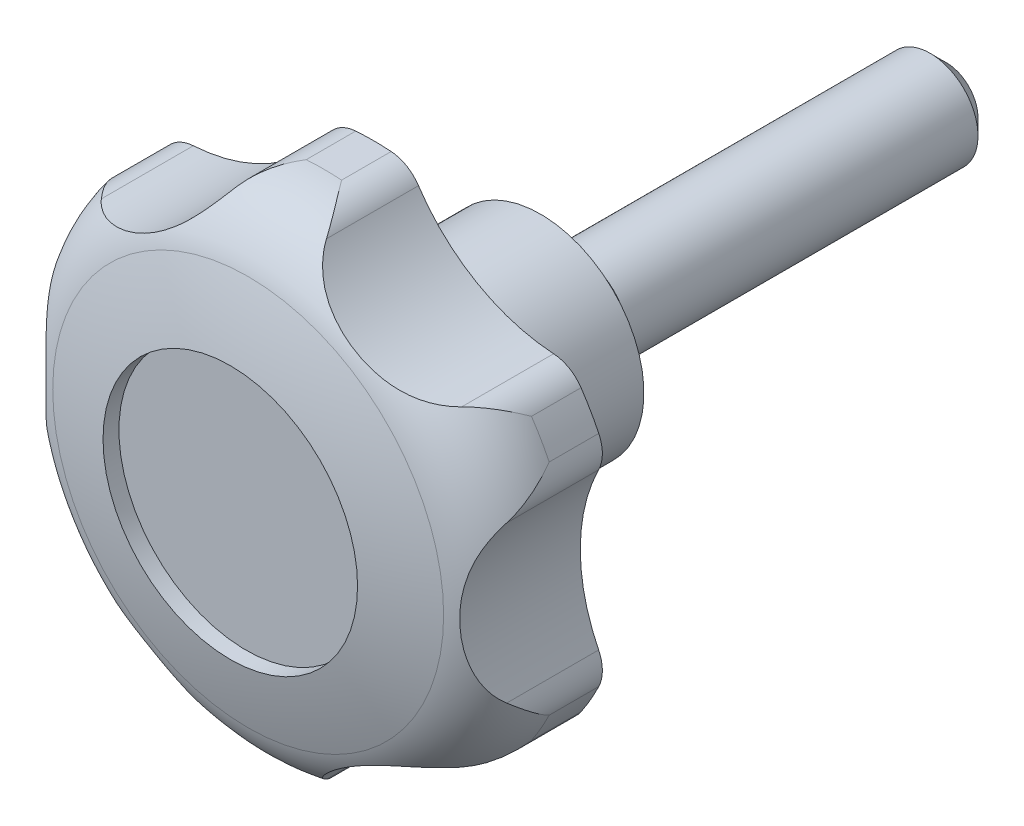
ISO-10303-21;
HEADER;
FILE_DESCRIPTION(('STEP AP214'),'2;1');
FILE_NAME('part.step','',(''),(''),'','','');
FILE_SCHEMA(('AUTOMOTIVE_DESIGN { 1 0 10303 214 1 1 1 1 }'));
ENDSEC;
DATA;
#1=APPLICATION_CONTEXT('core data for automotive mechanical design processes');
#2=APPLICATION_PROTOCOL_DEFINITION('international standard','automotive_design',2000,#1);
#3=PRODUCT_CONTEXT('',#1,'mechanical');
#4=PRODUCT('Part','Part','',(#3));
#5=PRODUCT_RELATED_PRODUCT_CATEGORY('part','',(#4));
#6=PRODUCT_DEFINITION_FORMATION('','',#4);
#7=PRODUCT_DEFINITION_CONTEXT('part definition',#1,'design');
#8=PRODUCT_DEFINITION('design','',#6,#7);
#9=PRODUCT_DEFINITION_SHAPE('','',#8);
#10=(LENGTH_UNIT() NAMED_UNIT(*) SI_UNIT(.MILLI.,.METRE.));
#11=(NAMED_UNIT(*) PLANE_ANGLE_UNIT() SI_UNIT($,.RADIAN.));
#12=(NAMED_UNIT(*) SI_UNIT($,.STERADIAN.) SOLID_ANGLE_UNIT());
#13=UNCERTAINTY_MEASURE_WITH_UNIT(LENGTH_MEASURE(1.E-05),#10,'distance_accuracy_value','');
#14=(GEOMETRIC_REPRESENTATION_CONTEXT(3) GLOBAL_UNCERTAINTY_ASSIGNED_CONTEXT((#13)) GLOBAL_UNIT_ASSIGNED_CONTEXT((#10,
#11,#12)) REPRESENTATION_CONTEXT('',''));
#15=CARTESIAN_POINT('',(0.,0.,0.));
#16=DIRECTION('',(0.,0.,1.));
#17=DIRECTION('',(1.,0.,0.));
#18=AXIS2_PLACEMENT_3D('',#15,#16,#17);
#19=CARTESIAN_POINT('',(0.,0.,44.4940294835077));
#20=DIRECTION('',(0.,0.,1.));
#21=DIRECTION('',(-1.,0.,0.));
#22=AXIS2_PLACEMENT_3D('',#19,#20,#21);
#23=CYLINDRICAL_SURFACE('',#22,31.5000000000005);
#24=CARTESIAN_POINT('',(0.,0.,22.));
#25=DIRECTION('',(0.,0.,1.));
#26=DIRECTION('',(-1.,0.,0.));
#27=AXIS2_PLACEMENT_3D('',#24,#25,#26);
#28=CIRCLE('',#27,31.5000000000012);
#29=CARTESIAN_POINT('',(26.0979777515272,-17.639318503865,22.));
#30=VERTEX_POINT('',#29);
#31=CARTESIAN_POINT('',(28.3250868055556,-13.7818524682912,22.));
#32=VERTEX_POINT('',#31);
#33=EDGE_CURVE('E478',#30,#32,#28,.T.);
#34=ORIENTED_EDGE('',*,*,#33,.T.);
#35=DIRECTION('',(0.,0.,1.));
#36=VECTOR('',#35,1.);
#37=CARTESIAN_POINT('',(28.3250868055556,-13.7818524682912,-50.));
#38=LINE('',#37,#36);
#39=CARTESIAN_POINT('',(28.3250868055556,-13.7818524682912,28.232767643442));
#40=VERTEX_POINT('',#39);
#41=EDGE_CURVE('E182',#32,#40,#38,.T.);
#42=ORIENTED_EDGE('',*,*,#41,.T.);
#43=CARTESIAN_POINT('',(0.,0.,28.232767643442));
#44=DIRECTION('',(0.,0.,1.));
#45=DIRECTION('',(-1.,0.,0.));
#46=AXIS2_PLACEMENT_3D('',#43,#44,#45);
#47=CIRCLE('',#46,31.5);
#48=CARTESIAN_POINT('',(26.0979777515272,-17.639318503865,28.232767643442));
#49=VERTEX_POINT('',#48);
#50=EDGE_CURVE('E198',#49,#40,#47,.T.);
#51=ORIENTED_EDGE('',*,*,#50,.F.);
#52=DIRECTION('',(0.,0.,1.));
#53=VECTOR('',#52,1.);
#54=CARTESIAN_POINT('',(26.0979777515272,-17.639318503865,-50.));
#55=LINE('',#54,#53);
#56=EDGE_CURVE('E544',#30,#49,#55,.T.);
#57=ORIENTED_EDGE('',*,*,#56,.F.);
#58=EDGE_LOOP('',(#34,#42,#51,#57));
#59=FACE_BOUND('',#58,.T.);
#60=ADVANCED_FACE('F14',(#59),#23,.T.);
#61=CARTESIAN_POINT('',(-2.22710905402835,-31.421170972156,22.));
#62=VERTEX_POINT('',#61);
#63=CARTESIAN_POINT('',(2.22710905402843,-31.4211709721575,22.));
#64=VERTEX_POINT('',#63);
#65=EDGE_CURVE('E481',#62,#64,#28,.T.);
#66=ORIENTED_EDGE('',*,*,#65,.T.);
#67=DIRECTION('',(0.,0.,1.));
#68=VECTOR('',#67,1.);
#69=CARTESIAN_POINT('',(2.22710905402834,-31.421170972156,-50.));
#70=LINE('',#69,#68);
#71=CARTESIAN_POINT('',(2.22710905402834,-31.421170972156,28.232767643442));
#72=VERTEX_POINT('',#71);
#73=EDGE_CURVE('E550',#64,#72,#70,.T.);
#74=ORIENTED_EDGE('',*,*,#73,.T.);
#75=CARTESIAN_POINT('',(-2.22710905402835,-31.421170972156,28.232767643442));
#76=VERTEX_POINT('',#75);
#77=EDGE_CURVE('E495',#76,#72,#47,.T.);
#78=ORIENTED_EDGE('',*,*,#77,.F.);
#79=DIRECTION('',(0.,0.,1.));
#80=VECTOR('',#79,1.);
#81=CARTESIAN_POINT('',(-2.22710905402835,-31.421170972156,-50.));
#82=LINE('',#81,#80);
#83=EDGE_CURVE('E553',#62,#76,#82,.T.);
#84=ORIENTED_EDGE('',*,*,#83,.F.);
#85=EDGE_LOOP('',(#66,#74,#78,#84));
#86=FACE_BOUND('',#85,.T.);
#87=ADVANCED_FACE('F445',(#86),#23,.T.);
#88=CARTESIAN_POINT('',(-28.3250868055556,-13.7818524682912,22.));
#89=VERTEX_POINT('',#88);
#90=CARTESIAN_POINT('',(-26.0979777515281,-17.6393185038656,22.));
#91=VERTEX_POINT('',#90);
#92=EDGE_CURVE('E484',#89,#91,#28,.T.);
#93=ORIENTED_EDGE('',*,*,#92,.T.);
#94=DIRECTION('',(0.,0.,1.));
#95=VECTOR('',#94,1.);
#96=CARTESIAN_POINT('',(-26.0979777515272,-17.639318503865,-50.));
#97=LINE('',#96,#95);
#98=CARTESIAN_POINT('',(-26.0979777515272,-17.639318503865,28.232767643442));
#99=VERTEX_POINT('',#98);
#100=EDGE_CURVE('E561',#91,#99,#97,.T.);
#101=ORIENTED_EDGE('',*,*,#100,.T.);
#102=CARTESIAN_POINT('',(-28.3250868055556,-13.7818524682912,28.232767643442));
#103=VERTEX_POINT('',#102);
#104=EDGE_CURVE('E491',#103,#99,#47,.T.);
#105=ORIENTED_EDGE('',*,*,#104,.F.);
#106=DIRECTION('',(0.,0.,1.));
#107=VECTOR('',#106,1.);
#108=CARTESIAN_POINT('',(-28.3250868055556,-13.7818524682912,-50.));
#109=LINE('',#108,#107);
#110=EDGE_CURVE('E564',#89,#103,#109,.T.);
#111=ORIENTED_EDGE('',*,*,#110,.F.);
#112=EDGE_LOOP('',(#93,#101,#105,#111));
#113=FACE_BOUND('',#112,.T.);
#114=ADVANCED_FACE('F453',(#113),#23,.T.);
#115=CARTESIAN_POINT('',(-26.0979777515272,17.639318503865,22.));
#116=VERTEX_POINT('',#115);
#117=CARTESIAN_POINT('',(-28.3250868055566,13.7818524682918,22.));
#118=VERTEX_POINT('',#117);
#119=EDGE_CURVE('E483',#116,#118,#28,.T.);
#120=ORIENTED_EDGE('',*,*,#119,.T.);
#121=DIRECTION('',(0.,0.,1.));
#122=VECTOR('',#121,1.);
#123=CARTESIAN_POINT('',(-28.3250868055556,13.7818524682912,-50.));
#124=LINE('',#123,#122);
#125=CARTESIAN_POINT('',(-28.3250868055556,13.7818524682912,28.232767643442));
#126=VERTEX_POINT('',#125);
#127=EDGE_CURVE('E37',#118,#126,#124,.T.);
#128=ORIENTED_EDGE('',*,*,#127,.T.);
#129=CARTESIAN_POINT('',(-26.0979777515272,17.639318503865,28.232767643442));
#130=VERTEX_POINT('',#129);
#131=EDGE_CURVE('E488',#130,#126,#47,.T.);
#132=ORIENTED_EDGE('',*,*,#131,.F.);
#133=DIRECTION('',(0.,0.,1.));
#134=VECTOR('',#133,1.);
#135=CARTESIAN_POINT('',(-26.0979777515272,17.639318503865,-50.));
#136=LINE('',#135,#134);
#137=EDGE_CURVE('E573',#116,#130,#136,.T.);
#138=ORIENTED_EDGE('',*,*,#137,.F.);
#139=EDGE_LOOP('',(#120,#128,#132,#138));
#140=FACE_BOUND('',#139,.T.);
#141=ADVANCED_FACE('F465',(#140),#23,.T.);
#142=CARTESIAN_POINT('',(2.22710905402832,31.4211709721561,22.));
#143=VERTEX_POINT('',#142);
#144=CARTESIAN_POINT('',(-2.22710905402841,31.4211709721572,22.));
#145=VERTEX_POINT('',#144);
#146=EDGE_CURVE('E479',#143,#145,#28,.T.);
#147=ORIENTED_EDGE('',*,*,#146,.T.);
#148=DIRECTION('',(0.,0.,1.));
#149=VECTOR('',#148,1.);
#150=CARTESIAN_POINT('',(-2.22710905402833,31.4211709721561,-50.));
#151=LINE('',#150,#149);
#152=CARTESIAN_POINT('',(-2.22710905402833,31.4211709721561,28.232767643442));
#153=VERTEX_POINT('',#152);
#154=EDGE_CURVE('E581',#145,#153,#151,.T.);
#155=ORIENTED_EDGE('',*,*,#154,.T.);
#156=CARTESIAN_POINT('',(2.22710905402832,31.4211709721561,28.232767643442));
#157=VERTEX_POINT('',#156);
#158=EDGE_CURVE('E935',#157,#153,#47,.T.);
#159=ORIENTED_EDGE('',*,*,#158,.F.);
#160=DIRECTION('',(0.,0.,1.));
#161=VECTOR('',#160,1.);
#162=CARTESIAN_POINT('',(2.22710905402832,31.4211709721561,-50.));
#163=LINE('',#162,#161);
#164=EDGE_CURVE('E584',#143,#157,#163,.T.);
#165=ORIENTED_EDGE('',*,*,#164,.F.);
#166=EDGE_LOOP('',(#147,#155,#159,#165));
#167=FACE_BOUND('',#166,.T.);
#168=ADVANCED_FACE('F457',(#167),#23,.T.);
#169=CARTESIAN_POINT('',(28.3250868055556,13.7818524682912,22.));
#170=VERTEX_POINT('',#169);
#171=CARTESIAN_POINT('',(26.0979777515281,17.6393185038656,22.));
#172=VERTEX_POINT('',#171);
#173=EDGE_CURVE('E471',#170,#172,#28,.T.);
#174=ORIENTED_EDGE('',*,*,#173,.T.);
#175=DIRECTION('',(0.,0.,1.));
#176=VECTOR('',#175,1.);
#177=CARTESIAN_POINT('',(26.0979777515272,17.639318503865,-50.));
#178=LINE('',#177,#176);
#179=CARTESIAN_POINT('',(26.0979777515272,17.639318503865,28.232767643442));
#180=VERTEX_POINT('',#179);
#181=EDGE_CURVE('E473',#172,#180,#178,.T.);
#182=ORIENTED_EDGE('',*,*,#181,.T.);
#183=CARTESIAN_POINT('',(28.3250868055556,13.7818524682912,28.232767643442));
#184=VERTEX_POINT('',#183);
#185=EDGE_CURVE('E942',#184,#180,#47,.T.);
#186=ORIENTED_EDGE('',*,*,#185,.F.);
#187=DIRECTION('',(0.,0.,1.));
#188=VECTOR('',#187,1.);
#189=CARTESIAN_POINT('',(28.3250868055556,13.7818524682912,-50.));
#190=LINE('',#189,#188);
#191=EDGE_CURVE('E475',#170,#184,#190,.T.);
#192=ORIENTED_EDGE('',*,*,#191,.F.);
#193=EDGE_LOOP('',(#174,#182,#186,#192));
#194=FACE_BOUND('',#193,.T.);
#195=ADVANCED_FACE('F447',(#194),#23,.T.);
#196=CARTESIAN_POINT('',(0.,0.,-38.3836717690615));
#197=DIRECTION('',(-1.,0.,0.));
#198=DIRECTION('',(0.,0.,-1.));
#199=AXIS2_PLACEMENT_3D('',#196,#197,#198);
#200=SPHERICAL_SURFACE('',#199,80.);
#201=CARTESIAN_POINT('',(0.,0.,-38.3836717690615));
#202=DIRECTION('',(0.,0.,1.));
#203=DIRECTION('',(-1.,0.,0.));
#204=AXIS2_PLACEMENT_3D('',#201,#202,#203);
#205=SPHERICAL_SURFACE('',#204,80.);
#206=CARTESIAN_POINT('',(0.,0.,37.7494018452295));
#207=DIRECTION('',(0.,0.,1.));
#208=DIRECTION('',(-1.,0.,0.));
#209=AXIS2_PLACEMENT_3D('',#206,#207,#208);
#210=CIRCLE('',#209,24.5714285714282);
#211=CARTESIAN_POINT('',(-24.5714285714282,0.,37.7494018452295));
#212=VERTEX_POINT('',#211);
#213=EDGE_CURVE('E494',#212,#212,#210,.T.);
#214=ORIENTED_EDGE('',*,*,#213,.T.);
#215=EDGE_LOOP('',(#214));
#216=FACE_BOUND('',#215,.T.);
#217=CARTESIAN_POINT('',(0.,0.,40.));
#218=DIRECTION('',(0.,0.,-1.));
#219=DIRECTION('',(1.,0.,0.));
#220=AXIS2_PLACEMENT_3D('',#217,#218,#219);
#221=CIRCLE('',#220,15.9999999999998);
#222=CARTESIAN_POINT('',(15.9999999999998,0.,40.));
#223=VERTEX_POINT('',#222);
#224=EDGE_CURVE('E597',#223,#223,#221,.T.);
#225=ORIENTED_EDGE('',*,*,#224,.T.);
#226=EDGE_LOOP('',(#225));
#227=FACE_BOUND('',#226,.T.);
#228=ADVANCED_FACE('F16',(#216,#227),#205,.T.);
#229=CARTESIAN_POINT('',(0.,0.,28.232767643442));
#230=DIRECTION('',(0.,0.,1.));
#231=DIRECTION('',(-1.,0.,0.));
#232=AXIS2_PLACEMENT_3D('',#229,#230,#231);
#233=TOROIDAL_SURFACE('',#232,21.5,10.0000000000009);
#234=CARTESIAN_POINT('',(26.0979777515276,-17.6393185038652,28.232767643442));
#235=CARTESIAN_POINT('',(26.095787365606,-17.642559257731,28.2381661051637));
#236=CARTESIAN_POINT('',(26.0935927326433,-17.6457971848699,28.2435646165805));
#237=CARTESIAN_POINT('',(25.9715048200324,-17.825418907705,28.5433082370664));
#238=CARTESIAN_POINT('',(25.8390070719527,-17.9933768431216,28.8377892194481));
#239=CARTESIAN_POINT('',(25.5505586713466,-18.3097081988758,29.4258443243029));
#240=CARTESIAN_POINT('',(25.3945993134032,-18.4580743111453,29.7194180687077));
#241=CARTESIAN_POINT('',(25.0606133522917,-18.7326906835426,30.3051183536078));
#242=CARTESIAN_POINT('',(24.8825534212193,-18.8589068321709,30.5972420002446));
#243=CARTESIAN_POINT('',(24.506441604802,-19.085843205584,31.1782260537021));
#244=CARTESIAN_POINT('',(24.3084021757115,-19.1865791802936,31.4670883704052));
#245=CARTESIAN_POINT('',(23.8777210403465,-19.3661170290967,32.0631220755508));
#246=CARTESIAN_POINT('',(23.6435822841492,-19.4425638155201,32.3699417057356));
#247=CARTESIAN_POINT('',(23.2789979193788,-19.5283534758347,32.8243186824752));
#248=CARTESIAN_POINT('',(23.15532869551,-19.5521302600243,32.9747023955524));
#249=CARTESIAN_POINT('',(22.9038337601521,-19.5894090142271,33.2733876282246));
#250=CARTESIAN_POINT('',(22.776005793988,-19.6029053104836,33.4216879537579));
#251=CARTESIAN_POINT('',(22.6463394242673,-19.610904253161,33.56876104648));
#252=B_SPLINE_CURVE_WITH_KNOTS('',3,(#234,#235,#236,#237,#238,#239,#240,#241,#242,#243,#244,
#245,#246,#247,#248,#249,#250,#251),.UNSPECIFIED.,.F.,.F.,(4,2,2,2,2,2,2,2,4),(0.,
0.0200000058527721,1.11045859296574,2.20132279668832,3.29385249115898,4.3857052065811,
5.5636296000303,6.15179568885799,6.74028614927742),.UNSPECIFIED.);
#253=CARTESIAN_POINT('',(22.6465394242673,-19.610891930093,33.5685341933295));
#254=VERTEX_POINT('',#253);
#255=EDGE_CURVE('E200',#49,#254,#252,.T.);
#256=ORIENTED_EDGE('',*,*,#255,.F.);
#257=ORIENTED_EDGE('',*,*,#50,.T.);
#258=CARTESIAN_POINT('',(28.3067007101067,-9.8068324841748,33.5687871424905));
#259=CARTESIAN_POINT('',(28.3508912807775,-9.89556849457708,33.4565618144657));
#260=CARTESIAN_POINT('',(28.3917729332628,-9.98498886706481,33.343612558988));
#261=CARTESIAN_POINT('',(28.4670914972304,-10.1648549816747,33.1164224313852));
#262=CARTESIAN_POINT('',(28.5015295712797,-10.2553005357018,33.002181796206));
#263=CARTESIAN_POINT('',(28.5953953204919,-10.5275208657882,32.6579333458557));
#264=CARTESIAN_POINT('',(28.6454651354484,-10.7103641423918,32.4261663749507));
#265=CARTESIAN_POINT('',(28.7218108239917,-11.0760554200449,31.9595965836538));
#266=CARTESIAN_POINT('',(28.7481337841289,-11.258902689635,31.7248007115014));
#267=CARTESIAN_POINT('',(28.7783405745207,-11.6229783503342,31.2525284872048));
#268=CARTESIAN_POINT('',(28.7822209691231,-11.8042064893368,31.0150517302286));
#269=CARTESIAN_POINT('',(28.7634739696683,-12.2980890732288,30.3589883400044));
#270=CARTESIAN_POINT('',(28.718758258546,-12.6072648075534,29.9382841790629));
#271=CARTESIAN_POINT('',(28.5687108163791,-13.2060043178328,29.0945771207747));
#272=CARTESIAN_POINT('',(28.4634632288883,-13.4955946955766,28.6715782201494));
#273=CARTESIAN_POINT('',(28.3285049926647,-13.7748156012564,28.2435645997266));
#274=CARTESIAN_POINT('',(28.3267981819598,-13.7783351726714,28.2381660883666));
#275=CARTESIAN_POINT('',(28.325086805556,-13.7818524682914,28.232767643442));
#276=B_SPLINE_CURVE_WITH_KNOTS('',3,(#258,#259,#260,#261,#262,#263,#264,#265,#266,#267,#268,
#269,#270,#271,#272,#273,#274,#275),.UNSPECIFIED.,.F.,.F.,(4,2,2,2,2,2,2,2,4),(0.,
0.449123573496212,0.898166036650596,1.79532231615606,2.6906957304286,3.58620621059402,
5.15403517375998,6.71968999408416,6.73968999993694),.UNSPECIFIED.);
#277=CARTESIAN_POINT('',(28.3068003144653,-9.8070324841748,33.5685341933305));
#278=VERTEX_POINT('',#277);
#279=EDGE_CURVE('E186',#278,#40,#276,.T.);
#280=ORIENTED_EDGE('',*,*,#279,.F.);
#281=CARTESIAN_POINT('',(28.306899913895,-9.80723248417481,33.5682812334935));
#282=CARTESIAN_POINT('',(28.2673881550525,-9.72789258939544,33.6686385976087));
#283=CARTESIAN_POINT('',(28.227286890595,-9.64616596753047,33.7668454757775));
#284=CARTESIAN_POINT('',(28.1461835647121,-9.47811588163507,33.9588369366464));
#285=CARTESIAN_POINT('',(28.1051815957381,-9.39179288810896,34.0526219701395));
#286=CARTESIAN_POINT('',(27.9813412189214,-9.1264084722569,34.326945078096));
#287=CARTESIAN_POINT('',(27.8975600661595,-8.94071625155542,34.5007229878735));
#288=CARTESIAN_POINT('',(27.7306770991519,-8.55559108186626,34.8277600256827));
#289=CARTESIAN_POINT('',(27.6475773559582,-8.3563223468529,34.9812149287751));
#290=CARTESIAN_POINT('',(27.4831867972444,-7.94415498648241,35.2697558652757));
#291=CARTESIAN_POINT('',(27.4018963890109,-7.73125333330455,35.4048377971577));
#292=CARTESIAN_POINT('',(27.2432790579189,-7.29467382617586,35.656528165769));
#293=CARTESIAN_POINT('',(27.1659377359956,-7.07104190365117,35.7732075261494));
#294=CARTESIAN_POINT('',(27.0164001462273,-6.61410095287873,35.9895642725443));
#295=CARTESIAN_POINT('',(26.944203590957,-6.38079246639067,36.0892426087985));
#296=CARTESIAN_POINT('',(26.8060036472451,-5.90558258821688,36.2729593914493));
#297=CARTESIAN_POINT('',(26.7400171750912,-5.66366006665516,36.356955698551));
#298=CARTESIAN_POINT('',(26.6154160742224,-5.17335643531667,36.5102592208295));
#299=CARTESIAN_POINT('',(26.556802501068,-4.92497440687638,36.5795643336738));
#300=CARTESIAN_POINT('',(26.4181661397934,-4.28729101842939,36.7386967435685));
#301=CARTESIAN_POINT('',(26.3437188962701,-3.8944576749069,36.8193385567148));
#302=CARTESIAN_POINT('',(26.215895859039,-3.1007499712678,36.9533643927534));
#303=CARTESIAN_POINT('',(26.1625301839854,-2.69987184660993,37.0067353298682));
#304=CARTESIAN_POINT('',(26.0777773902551,-1.8924390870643,37.0898241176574));
#305=CARTESIAN_POINT('',(26.0464425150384,-1.4858732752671,37.1194857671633));
#306=CARTESIAN_POINT('',(26.0064401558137,-0.67071626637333,37.1571359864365));
#307=CARTESIAN_POINT('',(25.9977694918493,-0.262125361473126,37.1651275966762));
#308=CARTESIAN_POINT('',(26.0032673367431,0.564334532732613,37.1600141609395));
#309=CARTESIAN_POINT('',(26.0179744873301,0.982197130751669,37.1464115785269));
#310=CARTESIAN_POINT('',(26.0710365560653,1.81513174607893,37.0960704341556));
#311=CARTESIAN_POINT('',(26.1093958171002,2.23020323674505,37.0593276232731));
#312=CARTESIAN_POINT('',(26.2090070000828,3.05355191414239,36.9600301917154));
#313=CARTESIAN_POINT('',(26.2702065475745,3.46184242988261,36.8975345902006));
#314=CARTESIAN_POINT('',(26.414233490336,4.26876333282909,36.7425858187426));
#315=CARTESIAN_POINT('',(26.4970492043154,4.66739881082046,36.6501488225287));
#316=CARTESIAN_POINT('',(26.6518972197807,5.32280567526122,36.466128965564));
#317=CARTESIAN_POINT('',(26.7186645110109,5.58351647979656,36.3840627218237));
#318=CARTESIAN_POINT('',(26.8599386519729,6.09659869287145,36.2024669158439));
#319=CARTESIAN_POINT('',(26.93444315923,6.34897259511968,36.1029426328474));
#320=CARTESIAN_POINT('',(27.0896194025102,6.84271708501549,35.8852972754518));
#321=CARTESIAN_POINT('',(27.1702731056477,7.08411676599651,35.7672295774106));
#322=CARTESIAN_POINT('',(27.3362070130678,7.5544558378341,35.5111726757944));
#323=CARTESIAN_POINT('',(27.4214863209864,7.78339762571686,35.3731873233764));
#324=CARTESIAN_POINT('',(27.574314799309,8.17463300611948,35.1113840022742));
#325=CARTESIAN_POINT('',(27.6413411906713,8.33998254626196,34.9918111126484));
#326=CARTESIAN_POINT('',(27.7758194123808,8.66099232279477,34.7405668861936));
#327=CARTESIAN_POINT('',(27.8432711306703,8.81665500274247,34.6088986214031));
#328=CARTESIAN_POINT('',(27.9779423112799,9.11836971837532,34.3326466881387));
#329=CARTESIAN_POINT('',(28.0451570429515,9.26434887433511,34.1879809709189));
#330=CARTESIAN_POINT('',(28.1777324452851,9.54473083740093,33.8868532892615));
#331=CARTESIAN_POINT('',(28.2430918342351,9.679125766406,33.7303834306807));
#332=CARTESIAN_POINT('',(28.306899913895,9.807232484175,33.5682812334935));
#333=B_SPLINE_CURVE_WITH_KNOTS('',3,(#281,#282,#283,#284,#285,#286,#287,#288,#289,#290,#291,
#292,#293,#294,#295,#296,#297,#298,#299,#300,#301,#302,#303,#304,#305,#306,#307,#308,#309,#310,
#311,#312,#313,#314,#315,#316,#317,#318,#319,#320,#321,#322,#323,#324,#325,#326,#327,#328,#329,
#330,#331,#332),.UNSPECIFIED.,.F.,.F.,(4,2,2,2,2,2,2,2,2,2,2,2,2,2,2,2,2,2,2,2,2,2,2,2,2,4),(0.,
0.401597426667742,0.803153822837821,1.60518118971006,2.39881165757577,3.19261900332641,
3.98328802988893,4.77391284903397,5.56663251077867,6.35946553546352,7.5812750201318,
8.80367023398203,10.028954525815,11.2540668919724,12.5078182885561,13.7617999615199,
15.0129236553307,16.2633726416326,17.1067811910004,17.9499351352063,18.7907051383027,
19.6313127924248,20.2751395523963,20.9188032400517,21.566861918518,22.2153579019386),.UNSPECIFIED.);
#334=CARTESIAN_POINT('',(28.3068003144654,9.80703248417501,33.5685341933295));
#335=VERTEX_POINT('',#334);
#336=EDGE_CURVE('E174',#278,#335,#333,.T.);
#337=ORIENTED_EDGE('',*,*,#336,.T.);
#338=CARTESIAN_POINT('',(28.325086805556,13.7818524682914,28.232767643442));
#339=CARTESIAN_POINT('',(28.3267981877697,13.7783351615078,28.2381661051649));
#340=CARTESIAN_POINT('',(28.3285049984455,13.7748155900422,28.2435646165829));
#341=CARTESIAN_POINT('',(28.4230180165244,13.5792734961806,28.5433082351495));
#342=CARTESIAN_POINT('',(28.5022249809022,13.3805481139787,28.83778921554));
#343=CARTESIAN_POINT('',(28.6319517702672,12.9725787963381,29.4258443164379));
#344=CARTESIAN_POINT('',(28.682460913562,12.763330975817,29.7194180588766));
#345=CARTESIAN_POINT('',(28.7532926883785,12.3367824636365,30.3051183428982));
#346=CARTESIAN_POINT('',(28.7735691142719,12.1194699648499,30.5972419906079));
#347=CARTESIAN_POINT('',(28.7820458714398,11.68027938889,31.1782260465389));
#348=CARTESIAN_POINT('',(28.7702660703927,11.4584042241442,31.4670883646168));
#349=CARTESIAN_POINT('',(28.7104093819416,10.995650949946,32.0631266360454));
#350=CARTESIAN_POINT('',(28.6595438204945,10.7546538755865,32.369950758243));
#351=CARTESIAN_POINT('',(28.551545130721,10.3960145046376,32.8243342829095));
#352=CARTESIAN_POINT('',(28.5103008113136,10.2770237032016,32.9747201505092));
#353=CARTESIAN_POINT('',(28.4168353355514,10.0405799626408,33.2734096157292));
#354=CARTESIAN_POINT('',(28.364608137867,9.92312790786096,33.4217120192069));
#355=CARTESIAN_POINT('',(28.3067007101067,9.80683248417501,33.5687871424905));
#356=B_SPLINE_CURVE_WITH_KNOTS('',3,(#338,#339,#340,#341,#342,#343,#344,#345,#346,#347,#348,
#349,#350,#351,#352,#353,#354,#355),.UNSPECIFIED.,.F.,.F.,(4,2,2,2,2,2,2,2,4),(0.,
0.0200000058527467,1.11045858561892,2.20132278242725,3.29385247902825,4.38570520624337,
5.56364695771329,6.15182175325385,6.74032093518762),.UNSPECIFIED.);
#357=EDGE_CURVE('E181',#184,#335,#356,.T.);
#358=ORIENTED_EDGE('',*,*,#357,.F.);
#359=ORIENTED_EDGE('',*,*,#185,.T.);
#360=CARTESIAN_POINT('',(22.6463394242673,19.610904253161,33.56876104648));
#361=CARTESIAN_POINT('',(22.7452824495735,19.6048058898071,33.456535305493));
#362=CARTESIAN_POINT('',(22.8431636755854,19.5954997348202,33.3435856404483));
#363=CARTESIAN_POINT('',(23.0365917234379,19.5707934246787,33.1163947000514));
#364=CARTESIAN_POINT('',(23.1321389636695,19.555394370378,33.0021536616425));
#365=CARTESIAN_POINT('',(23.4148216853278,19.5005727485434,32.6579040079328));
#366=CARTESIAN_POINT('',(23.5982035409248,19.4525117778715,32.4261362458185));
#367=CARTESIAN_POINT('',(23.953074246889,19.3357813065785,31.959564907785));
#368=CARTESIAN_POINT('',(24.1245860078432,19.2671529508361,31.7247682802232));
#369=CARTESIAN_POINT('',(24.4549878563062,19.1112728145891,31.2524945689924));
#370=CARTESIAN_POINT('',(24.6138760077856,19.0240181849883,31.015017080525));
#371=CARTESIAN_POINT('',(25.0322121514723,18.7608413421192,30.3589586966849));
#372=CARTESIAN_POINT('',(25.2776039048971,18.5675303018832,29.938260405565));
#373=CARTESIAN_POINT('',(25.7210962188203,18.1382205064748,29.0945651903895));
#374=CARTESIAN_POINT('',(25.9192618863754,17.9022813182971,28.6715722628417));
#375=CARTESIAN_POINT('',(26.0935927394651,17.6457971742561,28.2435645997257));
#376=CARTESIAN_POINT('',(26.095787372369,17.6425592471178,28.2381660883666));
#377=CARTESIAN_POINT('',(26.0979777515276,17.6393185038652,28.232767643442));
#378=B_SPLINE_CURVE_WITH_KNOTS('',3,(#360,#361,#362,#363,#364,#365,#366,#367,#368,#369,#370,
#371,#372,#373,#374,#375,#376,#377),.UNSPECIFIED.,.F.,.F.,(4,2,2,2,2,2,2,2,4),(0.,
0.449124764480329,0.89816841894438,1.79532709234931,2.69070285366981,3.5862156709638,
5.15402250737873,6.71965525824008,6.73965526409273),.UNSPECIFIED.);
#379=CARTESIAN_POINT('',(22.6465394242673,19.610891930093,33.56853419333));
#380=VERTEX_POINT('',#379);
#381=EDGE_CURVE('E247',#380,#180,#378,.T.);
#382=ORIENTED_EDGE('',*,*,#381,.F.);
#383=CARTESIAN_POINT('',(22.6467394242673,19.6108796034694,33.5683073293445));
#384=CARTESIAN_POINT('',(22.5582725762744,19.6163314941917,33.6686645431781));
#385=CARTESIAN_POINT('',(22.4674440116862,19.6224662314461,33.7668712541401));
#386=CARTESIAN_POINT('',(22.2813555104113,19.6362540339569,33.9588623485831));
#387=CARTESIAN_POINT('',(22.1860960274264,19.6439069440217,34.0526471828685));
#388=CARTESIAN_POINT('',(21.8943444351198,19.6693507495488,34.3269696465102));
#389=CARTESIAN_POINT('',(21.6916385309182,19.6896406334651,34.5007470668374));
#390=CARTESIAN_POINT('',(21.2746666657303,19.7376791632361,34.8277830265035));
#391=CARTESIAN_POINT('',(21.0605439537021,19.7653474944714,34.9812373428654));
#392=CARTESIAN_POINT('',(20.6213992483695,19.8290657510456,35.2697770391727));
#393=CARTESIAN_POINT('',(20.3963748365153,19.8651175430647,35.4048583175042));
#394=CARTESIAN_POINT('',(19.9389754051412,19.9460417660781,35.6565473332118));
#395=CARTESIAN_POINT('',(19.7066329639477,19.9908787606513,35.7732259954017));
#396=CARTESIAN_POINT('',(19.2361400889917,20.0898471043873,35.989581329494));
#397=CARTESIAN_POINT('',(18.9979899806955,20.1439779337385,36.0892589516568));
#398=CARTESIAN_POINT('',(18.5173447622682,20.2618995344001,36.2729743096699));
#399=CARTESIAN_POINT('',(18.2748398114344,20.3257155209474,36.3569699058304));
#400=CARTESIAN_POINT('',(17.787922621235,20.4629610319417,36.5102720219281));
#401=CARTESIAN_POINT('',(17.5435101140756,20.5363919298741,36.5795764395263));
#402=CARTESIAN_POINT('',(16.9219401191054,20.7351730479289,36.7387072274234));
#403=CARTESIAN_POINT('',(16.5445116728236,20.8671178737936,36.8193480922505));
#404=CARTESIAN_POINT('',(15.793226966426,21.1532765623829,36.9533720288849));
#405=CARTESIAN_POINT('',(15.419372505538,21.3075010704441,37.0067420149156));
#406=CARTESIAN_POINT('',(14.6777370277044,21.6378224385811,37.0898288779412));
#407=CARTESIAN_POINT('',(14.3099724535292,21.8139701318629,37.1194895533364));
#408=CARTESIAN_POINT('',(13.5840231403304,22.1869088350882,37.1571377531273));
#409=CARTESIAN_POINT('',(13.2258370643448,22.383696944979,37.1651283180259));
#410=CARTESIAN_POINT('',(12.5128497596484,22.8016915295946,37.1600126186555));
#411=CARTESIAN_POINT('',(12.1583233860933,23.0233612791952,37.1464088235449));
#412=CARTESIAN_POINT('',(11.4635114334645,23.4857850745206,37.096065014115));
#413=CARTESIAN_POINT('',(11.1232284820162,23.7265426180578,37.0593207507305));
#414=CARTESIAN_POINT('',(10.4599932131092,24.2244861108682,36.960020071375));
#415=CARTESIAN_POINT('',(10.1370031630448,24.4816333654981,36.8975226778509));
#416=CARTESIAN_POINT('',(9.51020318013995,25.0098279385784,36.7425698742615));
#417=CARTESIAN_POINT('',(9.20638299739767,25.2808676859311,36.6501306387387));
#418=CARTESIAN_POINT('',(8.71621052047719,25.7426742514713,36.466107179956));
#419=CARTESIAN_POINT('',(8.5238139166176,25.9308511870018,36.3840398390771));
#420=CARTESIAN_POINT('',(8.15011259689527,26.3097378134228,36.2024418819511));
#421=CARTESIAN_POINT('',(7.96880455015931,26.5004467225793,36.1029165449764));
#422=CARTESIAN_POINT('',(7.61880117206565,26.8817036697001,35.8852691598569));
#423=CARTESIAN_POINT('',(7.45007162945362,27.07225063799,35.767200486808));
#424=CARTESIAN_POINT('',(7.12571667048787,27.45112090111,35.5111417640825));
#425=CARTESIAN_POINT('',(6.97008873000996,27.639444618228,35.3731555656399));
#426=CARTESIAN_POINT('',(6.70768734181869,27.9674120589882,35.1113519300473));
#427=CARTESIAN_POINT('',(6.59800591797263,28.1081310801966,34.9917796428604));
#428=CARTESIAN_POINT('',(6.38724675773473,28.3850929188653,34.7405369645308));
#429=CARTESIAN_POINT('',(6.28616684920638,28.521336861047,34.6088696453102));
#430=CARTESIAN_POINT('',(6.09221377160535,28.7888183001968,34.3326200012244));
#431=CARTESIAN_POINT('',(5.99940134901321,28.9200152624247,34.1879556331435));
#432=CARTESIAN_POINT('',(5.82287463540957,29.1750154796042,33.8868310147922));
#433=CARTESIAN_POINT('',(5.73916652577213,29.2988136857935,33.730362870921));
#434=CARTESIAN_POINT('',(5.66012837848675,29.4181244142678,33.568262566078));
#435=B_SPLINE_CURVE_WITH_KNOTS('',3,(#383,#384,#385,#386,#387,#388,#389,#390,#391,#392,#393,
#394,#395,#396,#397,#398,#399,#400,#401,#402,#403,#404,#405,#406,#407,#408,#409,#410,#411,#412,
#413,#414,#415,#416,#417,#418,#419,#420,#421,#422,#423,#424,#425,#426,#427,#428,#429,#430,#431,
#432,#433,#434),.UNSPECIFIED.,.F.,.F.,(4,2,2,2,2,2,2,2,2,2,2,2,2,2,2,2,2,2,2,2,2,2,2,2,2,4),(0.,
0.401598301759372,0.803155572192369,1.60518467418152,2.39881681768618,3.19262584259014,
3.98329649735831,4.77392294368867,5.56664425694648,6.3594789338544,7.58129241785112,
8.80369163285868,10.028979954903,11.2540963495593,12.5078513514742,13.7618366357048,
15.0129638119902,16.2634162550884,17.1068205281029,17.9499701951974,18.7907359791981,
19.6313394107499,20.2751571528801,20.91881182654,21.5668612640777,22.215347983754),.UNSPECIFIED.);
#436=CARTESIAN_POINT('',(5.66026089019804,29.4179244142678,33.568534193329));
#437=VERTEX_POINT('',#436);
#438=EDGE_CURVE('E253',#380,#437,#435,.T.);
#439=ORIENTED_EDGE('',*,*,#438,.T.);
#440=CARTESIAN_POINT('',(2.22710905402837,31.4211709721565,28.232767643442));
#441=CARTESIAN_POINT('',(2.23101082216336,31.4208944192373,28.2381661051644));
#442=CARTESIAN_POINT('',(2.23491226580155,31.4206127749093,28.2435646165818));
#443=CARTESIAN_POINT('',(2.45151319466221,31.4046924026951,28.5433082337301));
#444=CARTESIAN_POINT('',(2.66321790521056,31.3739249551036,28.8377892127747));
#445=CARTESIAN_POINT('',(3.08139309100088,31.282286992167,29.4258443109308));
#446=CARTESIAN_POINT('',(3.2878615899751,31.2214052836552,29.7194180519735));
#447=CARTESIAN_POINT('',(3.69267932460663,31.0694731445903,30.3051183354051));
#448=CARTESIAN_POINT('',(3.89101568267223,30.9783767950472,30.5972419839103));
#449=CARTESIAN_POINT('',(4.27560425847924,30.7661225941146,31.1782260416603));
#450=CARTESIAN_POINT('',(4.46186388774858,30.6449834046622,31.4670883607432));
#451=CARTESIAN_POINT('',(4.8326936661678,30.3617678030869,32.0631298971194));
#452=CARTESIAN_POINT('',(5.01597231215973,30.197216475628,32.3699572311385));
#453=CARTESIAN_POINT('',(5.27256609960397,29.9243637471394,32.824345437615));
#454=CARTESIAN_POINT('',(5.35499370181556,29.8291484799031,32.9747328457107));
#455=CARTESIAN_POINT('',(5.51302848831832,29.629980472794,33.2734253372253));
#456=CARTESIAN_POINT('',(5.58863188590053,29.5260229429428,33.4217292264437));
#457=CARTESIAN_POINT('',(5.66039339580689,29.4177244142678,33.5688058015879));
#458=B_SPLINE_CURVE_WITH_KNOTS('',3,(#440,#441,#442,#443,#444,#445,#446,#447,#448,#449,#450,
#451,#452,#453,#454,#455,#456,#457),.UNSPECIFIED.,.F.,.F.,(4,2,2,2,2,2,2,2,4),(0.,
0.0200000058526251,1.11045858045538,2.20132277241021,3.29385247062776,4.38570520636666,
5.56365936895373,6.15184038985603,6.74034580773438),.UNSPECIFIED.);
#459=EDGE_CURVE('E276',#157,#437,#458,.T.);
#460=ORIENTED_EDGE('',*,*,#459,.F.);
#461=ORIENTED_EDGE('',*,*,#158,.T.);
#462=CARTESIAN_POINT('',(-5.66039339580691,29.4177244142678,33.5688058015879));
#463=CARTESIAN_POINT('',(-5.60564139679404,29.5003626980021,33.4565807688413));
#464=CARTESIAN_POINT('',(-5.54864226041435,29.5804775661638,33.3436318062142));
#465=CARTESIAN_POINT('',(-5.43053361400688,29.7356386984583,33.1164422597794));
#466=CARTESIAN_POINT('',(-5.36942484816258,29.8106858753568,33.0022019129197));
#467=CARTESIAN_POINT('',(-5.18060902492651,30.028086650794,32.6579543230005));
#468=CARTESIAN_POINT('',(-5.04729767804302,30.1628703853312,32.4261879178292));
#469=CARTESIAN_POINT('',(-4.76877388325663,30.4118341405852,31.9596192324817));
#470=CARTESIAN_POINT('',(-4.62358561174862,30.5260545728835,31.7248239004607));
#471=CARTESIAN_POINT('',(-4.32339145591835,30.7342532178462,31.2525527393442));
#472=CARTESIAN_POINT('',(-4.16838407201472,30.8282283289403,31.0150765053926));
#473=CARTESIAN_POINT('',(-3.73129394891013,31.0589375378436,30.359009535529));
#474=CARTESIAN_POINT('',(-3.44117937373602,31.1748025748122,29.9383011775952));
#475=CARTESIAN_POINT('',(-2.84762630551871,31.3442303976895,29.0945856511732));
#476=CARTESIAN_POINT('',(-2.54420684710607,31.3978793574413,28.6715824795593));
#477=CARTESIAN_POINT('',(-2.23491225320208,31.4206127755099,28.2435645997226));
#478=CARTESIAN_POINT('',(-2.23101080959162,31.4208944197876,28.2381660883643));
#479=CARTESIAN_POINT('',(-2.22710905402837,31.4211709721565,28.232767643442));
#480=B_SPLINE_CURVE_WITH_KNOTS('',3,(#462,#463,#464,#465,#466,#467,#468,#469,#470,#471,#472,
#473,#474,#475,#476,#477,#478,#479),.UNSPECIFIED.,.F.,.F.,(4,2,2,2,2,2,2,2,4),(0.,
0.44912272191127,0.898164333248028,1.7953189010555,2.69069063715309,3.58619944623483,
5.15404423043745,6.71971483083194,6.73971483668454),.UNSPECIFIED.);
#481=CARTESIAN_POINT('',(-5.66026089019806,29.4179244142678,33.56853419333));
#482=VERTEX_POINT('',#481);
#483=EDGE_CURVE('E282',#482,#153,#480,.T.);
#484=ORIENTED_EDGE('',*,*,#483,.F.);
#485=CARTESIAN_POINT('',(-5.66012837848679,29.4181244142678,33.568262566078));
#486=CARTESIAN_POINT('',(-5.70908256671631,29.3442366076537,33.6686200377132));
#487=CARTESIAN_POINT('',(-5.75980896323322,29.268644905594,33.7668270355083));
#488=CARTESIAN_POINT('',(-5.86479233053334,29.1143829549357,33.9588187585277));
#489=CARTESIAN_POINT('',(-5.91904894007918,29.0357130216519,34.0526039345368));
#490=CARTESIAN_POINT('',(-6.08695745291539,28.7957728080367,34.3269275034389));
#491=CARTESIAN_POINT('',(-6.20588041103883,28.6303706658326,34.5007057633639));
#492=CARTESIAN_POINT('',(-6.45596580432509,28.2932842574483,34.8277435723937));
#493=CARTESIAN_POINT('',(-6.58698706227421,28.1216838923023,34.9811988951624));
#494=CARTESIAN_POINT('',(-6.86173785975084,27.7732347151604,35.2697407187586));
#495=CARTESIAN_POINT('',(-7.00547022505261,27.5963847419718,35.4048231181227));
#496=CARTESIAN_POINT('',(-7.30424916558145,27.2407290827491,35.6565144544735));
#497=CARTESIAN_POINT('',(-7.45924876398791,27.0619338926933,35.7731943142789));
#498=CARTESIAN_POINT('',(-7.7802011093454,26.7039606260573,35.9895520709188));
#499=CARTESIAN_POINT('',(-7.94615324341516,26.5247825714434,36.089230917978));
#500=CARTESIAN_POINT('',(-8.28859577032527,26.1674933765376,36.2729487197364));
#501=CARTESIAN_POINT('',(-8.46511292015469,25.9893863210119,36.3569455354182));
#502=CARTESIAN_POINT('',(-8.82742645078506,25.6363270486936,36.5102500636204));
#503=CARTESIAN_POINT('',(-9.0132241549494,25.4613752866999,36.5795556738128));
#504=CARTESIAN_POINT('',(-9.49615408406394,25.022471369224,36.7386892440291));
#505=CARTESIAN_POINT('',(-9.79913285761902,24.7615817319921,36.8193317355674));
#506=CARTESIAN_POINT('',(-10.4225898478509,24.2540302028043,36.9533589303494));
#507=CARTESIAN_POINT('',(-10.7430763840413,24.0073751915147,37.0067305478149));
#508=CARTESIAN_POINT('',(-11.3999547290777,23.5302607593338,37.089820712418));
#509=CARTESIAN_POINT('',(-11.7363823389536,23.2998409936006,37.1194830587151));
#510=CARTESIAN_POINT('',(-12.422325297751,22.8576191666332,37.1571347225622));
#511=CARTESIAN_POINT('',(-12.7718388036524,22.645814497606,37.1651270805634));
#512=CARTESIAN_POINT('',(-13.4903205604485,22.2373452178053,37.1600152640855));
#513=CARTESIAN_POINT('',(-13.8595526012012,22.041150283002,37.1464135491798));
#514=CARTESIAN_POINT('',(-14.6074239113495,21.670635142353,37.096074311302));
#515=CARTESIAN_POINT('',(-14.9860648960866,21.4963189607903,37.0593325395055));
#516=CARTESIAN_POINT('',(-15.7489092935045,21.1709092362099,36.9600374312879));
#517=CARTESIAN_POINT('',(-16.1330980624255,21.0197636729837,36.8975431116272));
#518=CARTESIAN_POINT('',(-16.9039237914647,20.7410327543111,36.7425972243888));
#519=CARTESIAN_POINT('',(-17.290559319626,20.6134347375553,36.6501618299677));
#520=CARTESIAN_POINT('',(-17.9355827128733,20.4198317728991,36.4661445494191));
#521=CARTESIAN_POINT('',(-18.1947496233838,20.3472975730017,36.3840790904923));
#522=CARTESIAN_POINT('',(-18.7097312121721,20.2131016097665,36.2024848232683));
#523=CARTESIAN_POINT('',(-18.9655468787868,20.151436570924,36.1029612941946));
#524=CARTESIAN_POINT('',(-19.4707327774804,20.0389492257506,35.8853173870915));
#525=CARTESIAN_POINT('',(-19.7201191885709,19.9880967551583,35.7672503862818));
#526=CARTESIAN_POINT('',(-20.2104144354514,19.8966287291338,35.5111947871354));
#527=CARTESIAN_POINT('',(-20.4513248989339,19.8560111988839,35.3732100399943));
#528=CARTESIAN_POINT('',(-20.8665614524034,19.7927457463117,35.1114076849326));
#529=CARTESIAN_POINT('',(-21.043272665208,19.7681170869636,34.9918351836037));
#530=CARTESIAN_POINT('',(-21.3885166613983,19.7240729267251,34.7405916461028));
#531=CARTESIAN_POINT('',(-21.5570515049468,19.7046561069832,34.608923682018));
#532=CARTESIAN_POINT('',(-21.8856820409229,19.6704267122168,34.332672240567));
#533=CARTESIAN_POINT('',(-22.0457122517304,19.6556464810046,34.1880067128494));
#534=CARTESIAN_POINT('',(-22.3548202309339,19.6302685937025,33.886879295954));
#535=CARTESIAN_POINT('',(-22.5038905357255,19.6196737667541,33.7304095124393));
#536=CARTESIAN_POINT('',(-22.6467394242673,19.6108796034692,33.5683073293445));
#537=B_SPLINE_CURVE_WITH_KNOTS('',3,(#485,#486,#487,#488,#489,#490,#491,#492,#493,#494,#495,
#496,#497,#498,#499,#500,#501,#502,#503,#504,#505,#506,#507,#508,#509,#510,#511,#512,#513,#514,
#515,#516,#517,#518,#519,#520,#521,#522,#523,#524,#525,#526,#527,#528,#529,#530,#531,#532,#533,
#534,#535,#536),.UNSPECIFIED.,.F.,.F.,(4,2,2,2,2,2,2,2,2,2,2,2,2,2,2,2,2,2,2,2,2,2,2,2,2,4),(0.,
0.401596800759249,0.80315257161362,1.60517869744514,2.39880796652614,3.19261411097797,
3.98328197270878,4.77390562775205,5.56662410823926,6.35945595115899,7.58126257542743,
8.80365492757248,10.0289363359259,11.254045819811,12.507794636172,13.7617737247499,
15.0128949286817,16.2633414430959,17.1067530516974,17.949910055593,18.790683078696,
19.6312937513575,20.2751227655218,20.9187887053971,21.5668497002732,22.2153480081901),.UNSPECIFIED.);
#538=CARTESIAN_POINT('',(-22.6465394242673,19.610891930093,33.5685341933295));
#539=VERTEX_POINT('',#538);
#540=EDGE_CURVE('E288',#482,#539,#537,.T.);
#541=ORIENTED_EDGE('',*,*,#540,.T.);
#542=CARTESIAN_POINT('',(-26.0979777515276,17.6393185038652,28.232767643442));
#543=CARTESIAN_POINT('',(-26.0957873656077,17.6425592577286,28.2381661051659));
#544=CARTESIAN_POINT('',(-26.0935927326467,17.645797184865,28.2435646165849));
#545=CARTESIAN_POINT('',(-25.9715048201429,17.8254189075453,28.5433082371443));
#546=CARTESIAN_POINT('',(-25.8390070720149,17.9933768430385,28.8377892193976));
#547=CARTESIAN_POINT('',(-25.5505586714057,18.3097081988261,29.4258443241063));
#548=CARTESIAN_POINT('',(-25.3945993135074,18.4580743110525,29.7194180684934));
#549=CARTESIAN_POINT('',(-25.0606133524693,18.7326906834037,30.305118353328));
#550=CARTESIAN_POINT('',(-24.8825534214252,18.8589068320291,30.597241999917));
#551=CARTESIAN_POINT('',(-24.5064416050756,19.0858432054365,31.178226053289));
#552=CARTESIAN_POINT('',(-24.3084021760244,19.186579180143,31.4670883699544));
#553=CARTESIAN_POINT('',(-23.8777210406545,19.3661170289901,32.0631220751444));
#554=CARTESIAN_POINT('',(-23.6435822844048,19.4425638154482,32.3699417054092));
#555=CARTESIAN_POINT('',(-23.2789979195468,19.5283534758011,32.8243186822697));
#556=CARTESIAN_POINT('',(-23.1553286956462,19.5521302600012,32.9747023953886));
#557=CARTESIAN_POINT('',(-22.9038337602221,19.5894090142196,33.2733876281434));
#558=CARTESIAN_POINT('',(-22.7760057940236,19.6029053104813,33.4216879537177));
#559=CARTESIAN_POINT('',(-22.6463394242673,19.610904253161,33.56876104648));
#560=B_SPLINE_CURVE_WITH_KNOTS('',3,(#542,#543,#544,#545,#546,#547,#548,#549,#550,#551,#552,
#553,#554,#555,#556,#557,#558,#559),.UNSPECIFIED.,.F.,.F.,(4,2,2,2,2,2,2,2,4),(0.,
0.0200000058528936,1.11045859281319,2.20132279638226,3.29385249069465,4.3857052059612,
5.5636295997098,6.1517956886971,6.74028614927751),.UNSPECIFIED.);
#561=EDGE_CURVE('E295',#130,#539,#560,.T.);
#562=ORIENTED_EDGE('',*,*,#561,.F.);
#563=ORIENTED_EDGE('',*,*,#131,.T.);
#564=CARTESIAN_POINT('',(-28.3067007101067,9.8068324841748,33.5687871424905));
#565=CARTESIAN_POINT('',(-28.3508912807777,9.89556849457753,33.4565618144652));
#566=CARTESIAN_POINT('',(-28.3917729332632,9.98498886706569,33.343612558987));
#567=CARTESIAN_POINT('',(-28.467091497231,10.1648549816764,33.1164224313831));
#568=CARTESIAN_POINT('',(-28.5015295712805,10.255300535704,33.0021817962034));
#569=CARTESIAN_POINT('',(-28.5953953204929,10.5275208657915,32.6579333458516));
#570=CARTESIAN_POINT('',(-28.6454651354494,10.7103641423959,32.4261663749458));
#571=CARTESIAN_POINT('',(-28.7218108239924,11.0760554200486,31.9595965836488));
#572=CARTESIAN_POINT('',(-28.7481337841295,11.2589026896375,31.7248007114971));
#573=CARTESIAN_POINT('',(-28.7783405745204,11.6229783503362,31.2525284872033));
#574=CARTESIAN_POINT('',(-28.7822209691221,11.8042064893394,31.0150517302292));
#575=CARTESIAN_POINT('',(-28.76347396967,12.2980890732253,30.3589883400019));
#576=CARTESIAN_POINT('',(-28.7187582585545,12.6072648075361,29.9382841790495));
#577=CARTESIAN_POINT('',(-28.5687108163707,13.2060043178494,29.0945771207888));
#578=CARTESIAN_POINT('',(-28.4634632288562,13.4955946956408,28.6715782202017));
#579=CARTESIAN_POINT('',(-28.3285049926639,13.7748156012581,28.2435645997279));
#580=CARTESIAN_POINT('',(-28.3267981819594,13.7783351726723,28.2381660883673));
#581=CARTESIAN_POINT('',(-28.325086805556,13.7818524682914,28.232767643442));
#582=B_SPLINE_CURVE_WITH_KNOTS('',3,(#564,#565,#566,#567,#568,#569,#570,#571,#572,#573,#574,
#575,#576,#577,#578,#579,#580,#581),.UNSPECIFIED.,.F.,.F.,(4,2,2,2,2,2,2,2,4),(0.,
0.449123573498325,0.898166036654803,1.79532231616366,2.69069573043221,3.58620621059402,
5.15403517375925,6.71968999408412,6.73968999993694),.UNSPECIFIED.);
#583=CARTESIAN_POINT('',(-28.3068003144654,9.8070324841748,33.56853419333));
#584=VERTEX_POINT('',#583);
#585=EDGE_CURVE('E318',#584,#126,#582,.T.);
#586=ORIENTED_EDGE('',*,*,#585,.F.);
#587=CARTESIAN_POINT('',(-28.306899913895,9.8072324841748,33.5682812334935));
#588=CARTESIAN_POINT('',(-28.2673881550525,9.72789258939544,33.6686385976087));
#589=CARTESIAN_POINT('',(-28.227286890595,9.64616596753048,33.7668454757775));
#590=CARTESIAN_POINT('',(-28.1461835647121,9.47811588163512,33.9588369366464));
#591=CARTESIAN_POINT('',(-28.1051815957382,9.39179288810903,34.0526219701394));
#592=CARTESIAN_POINT('',(-27.9813412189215,9.12640847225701,34.3269450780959));
#593=CARTESIAN_POINT('',(-27.8975600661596,8.94071625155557,34.5007229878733));
#594=CARTESIAN_POINT('',(-27.730677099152,8.5555910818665,34.8277600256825));
#595=CARTESIAN_POINT('',(-27.6475773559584,8.3563223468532,34.981214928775));
#596=CARTESIAN_POINT('',(-27.4831867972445,7.94415498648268,35.2697558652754));
#597=CARTESIAN_POINT('',(-27.4018963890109,7.73125333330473,35.4048377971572));
#598=CARTESIAN_POINT('',(-27.2432790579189,7.29467382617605,35.6565281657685));
#599=CARTESIAN_POINT('',(-27.1659377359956,7.07104190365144,35.7732075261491));
#600=CARTESIAN_POINT('',(-27.0164001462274,6.61410095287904,35.9895642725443));
#601=CARTESIAN_POINT('',(-26.9442035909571,6.38079246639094,36.0892426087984));
#602=CARTESIAN_POINT('',(-26.8060036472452,5.90558258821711,36.2729593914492));
#603=CARTESIAN_POINT('',(-26.7400171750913,5.66366006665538,36.3569556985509));
#604=CARTESIAN_POINT('',(-26.6154160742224,5.17335643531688,36.5102592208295));
#605=CARTESIAN_POINT('',(-26.556802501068,4.92497440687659,36.5795643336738));
#606=CARTESIAN_POINT('',(-26.4181661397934,4.28729101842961,36.7386967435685));
#607=CARTESIAN_POINT('',(-26.3437188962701,3.89445767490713,36.8193385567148));
#608=CARTESIAN_POINT('',(-26.2158958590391,3.10074997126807,36.9533643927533));
#609=CARTESIAN_POINT('',(-26.1625301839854,2.69987184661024,37.0067353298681));
#610=CARTESIAN_POINT('',(-26.0777773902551,1.89243908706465,37.0898241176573));
#611=CARTESIAN_POINT('',(-26.0464425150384,1.48587327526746,37.1194857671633));
#612=CARTESIAN_POINT('',(-26.0064401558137,0.670716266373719,37.1571359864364));
#613=CARTESIAN_POINT('',(-25.9977694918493,0.262125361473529,37.1651275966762));
#614=CARTESIAN_POINT('',(-26.0032673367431,-0.564334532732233,37.1600141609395));
#615=CARTESIAN_POINT('',(-26.0179744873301,-0.982197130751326,37.1464115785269));
#616=CARTESIAN_POINT('',(-26.0710365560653,-1.81513174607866,37.0960704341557));
#617=CARTESIAN_POINT('',(-26.1093958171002,-2.23020323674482,37.0593276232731));
#618=CARTESIAN_POINT('',(-26.2090070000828,-3.05355191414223,36.9600301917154));
#619=CARTESIAN_POINT('',(-26.2702065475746,-3.46184242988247,36.8975345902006));
#620=CARTESIAN_POINT('',(-26.414233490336,-4.26876333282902,36.7425858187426));
#621=CARTESIAN_POINT('',(-26.4970492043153,-4.66739881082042,36.6501488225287));
#622=CARTESIAN_POINT('',(-26.6518972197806,-5.32280567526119,36.466128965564));
#623=CARTESIAN_POINT('',(-26.7186645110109,-5.58351647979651,36.3840627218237));
#624=CARTESIAN_POINT('',(-26.8599386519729,-6.09659869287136,36.202466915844));
#625=CARTESIAN_POINT('',(-26.93444315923,-6.34897259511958,36.1029426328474));
#626=CARTESIAN_POINT('',(-27.0896194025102,-6.84271708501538,35.8852972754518));
#627=CARTESIAN_POINT('',(-27.1702731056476,-7.0841167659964,35.7672295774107));
#628=CARTESIAN_POINT('',(-27.3362070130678,-7.55445583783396,35.5111726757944));
#629=CARTESIAN_POINT('',(-27.4214863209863,-7.78339762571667,35.3731873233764));
#630=CARTESIAN_POINT('',(-27.5743147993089,-8.17463300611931,35.1113840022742));
#631=CARTESIAN_POINT('',(-27.6413411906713,-8.33998254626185,34.9918111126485));
#632=CARTESIAN_POINT('',(-27.7758194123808,-8.66099232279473,34.7405668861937));
#633=CARTESIAN_POINT('',(-27.8432711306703,-8.81665500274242,34.6088986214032));
#634=CARTESIAN_POINT('',(-27.9779423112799,-9.11836971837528,34.3326466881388));
#635=CARTESIAN_POINT('',(-28.0451570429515,-9.26434887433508,34.187980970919));
#636=CARTESIAN_POINT('',(-28.177732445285,-9.54473083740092,33.8868532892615));
#637=CARTESIAN_POINT('',(-28.2430918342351,-9.679125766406,33.7303834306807));
#638=CARTESIAN_POINT('',(-28.306899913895,-9.807232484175,33.5682812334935));
#639=B_SPLINE_CURVE_WITH_KNOTS('',3,(#587,#588,#589,#590,#591,#592,#593,#594,#595,#596,#597,
#598,#599,#600,#601,#602,#603,#604,#605,#606,#607,#608,#609,#610,#611,#612,#613,#614,#615,#616,
#617,#618,#619,#620,#621,#622,#623,#624,#625,#626,#627,#628,#629,#630,#631,#632,#633,#634,#635,
#636,#637,#638),.UNSPECIFIED.,.F.,.F.,(4,2,2,2,2,2,2,2,2,2,2,2,2,2,2,2,2,2,2,2,2,2,2,2,2,4),(0.,
0.401597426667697,0.803153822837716,1.60518118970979,2.39881165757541,3.19261900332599,
3.98328802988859,4.77391284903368,5.56663251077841,6.35946553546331,7.58127502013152,
8.80367023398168,10.0289545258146,11.254066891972,12.5078182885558,13.7617999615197,
15.0129236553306,16.2633726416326,17.1067811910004,17.9499351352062,18.7907051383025,
19.6313127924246,20.2751395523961,20.9188032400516,21.5668619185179,22.2153579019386),.UNSPECIFIED.);
#640=CARTESIAN_POINT('',(-28.3068003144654,-9.807032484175,33.5685341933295));
#641=VERTEX_POINT('',#640);
#642=EDGE_CURVE('E324',#584,#641,#639,.T.);
#643=ORIENTED_EDGE('',*,*,#642,.T.);
#644=CARTESIAN_POINT('',(-28.3250868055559,-13.7818524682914,28.232767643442));
#645=CARTESIAN_POINT('',(-28.3267981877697,-13.7783351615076,28.2381661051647));
#646=CARTESIAN_POINT('',(-28.3285049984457,-13.7748155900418,28.2435646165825));
#647=CARTESIAN_POINT('',(-28.4230180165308,-13.579273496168,28.5433082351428));
#648=CARTESIAN_POINT('',(-28.5022249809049,-13.3805481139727,28.8377892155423));
#649=CARTESIAN_POINT('',(-28.6319517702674,-12.9725787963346,29.4258443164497));
#650=CARTESIAN_POINT('',(-28.6824609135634,-12.7633309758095,29.7194180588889));
#651=CARTESIAN_POINT('',(-28.7532926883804,-12.3367824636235,30.305118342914));
#652=CARTESIAN_POINT('',(-28.7735691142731,-12.1194699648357,30.5972419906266));
#653=CARTESIAN_POINT('',(-28.7820458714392,-11.6802793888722,31.1782260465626));
#654=CARTESIAN_POINT('',(-28.7702660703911,-11.4584042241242,31.4670883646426));
#655=CARTESIAN_POINT('',(-28.7104093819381,-10.9956509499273,32.0631266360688));
#656=CARTESIAN_POINT('',(-28.6595438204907,-10.7546538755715,32.3699507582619));
#657=CARTESIAN_POINT('',(-28.5515451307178,-10.3960145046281,32.8243342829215));
#658=CARTESIAN_POINT('',(-28.5103008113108,-10.277023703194,32.9747201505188));
#659=CARTESIAN_POINT('',(-28.4168353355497,-10.0405799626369,33.2734096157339));
#660=CARTESIAN_POINT('',(-28.3646081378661,-9.92312790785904,33.4217120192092));
#661=CARTESIAN_POINT('',(-28.3067007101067,-9.80683248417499,33.5687871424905));
#662=B_SPLINE_CURVE_WITH_KNOTS('',3,(#644,#645,#646,#647,#648,#649,#650,#651,#652,#653,#654,
#655,#656,#657,#658,#659,#660,#661),.UNSPECIFIED.,.F.,.F.,(4,2,2,2,2,2,2,2,4),(0.,
0.0200000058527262,1.11045858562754,2.20132278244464,3.29385247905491,4.38570520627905,
5.56364695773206,6.15182175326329,6.74032093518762),.UNSPECIFIED.);
#663=EDGE_CURVE('E331',#103,#641,#662,.T.);
#664=ORIENTED_EDGE('',*,*,#663,.F.);
#665=ORIENTED_EDGE('',*,*,#104,.T.);
#666=CARTESIAN_POINT('',(-22.6463394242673,-19.610904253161,33.56876104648));
#667=CARTESIAN_POINT('',(-22.7452824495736,-19.6048058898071,33.4565353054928));
#668=CARTESIAN_POINT('',(-22.8431636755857,-19.5954997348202,33.3435856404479));
#669=CARTESIAN_POINT('',(-23.0365917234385,-19.5707934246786,33.1163947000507));
#670=CARTESIAN_POINT('',(-23.1321389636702,-19.5553943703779,33.0021536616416));
#671=CARTESIAN_POINT('',(-23.4148216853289,-19.5005727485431,32.6579040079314));
#672=CARTESIAN_POINT('',(-23.5982035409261,-19.4525117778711,32.4261362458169));
#673=CARTESIAN_POINT('',(-23.9530742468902,-19.3357813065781,31.9595649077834));
#674=CARTESIAN_POINT('',(-24.1245860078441,-19.2671529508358,31.7247682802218));
#675=CARTESIAN_POINT('',(-24.4549878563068,-19.1112728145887,31.2524945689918));
#676=CARTESIAN_POINT('',(-24.6138760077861,-19.0240181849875,31.015017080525));
#677=CARTESIAN_POINT('',(-25.0322121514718,-18.7608413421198,30.3589586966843));
#678=CARTESIAN_POINT('',(-25.2776039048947,-18.5675303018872,29.9382604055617));
#679=CARTESIAN_POINT('',(-25.7210962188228,-18.1382205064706,29.0945651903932));
#680=CARTESIAN_POINT('',(-25.9192618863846,-17.9022813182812,28.6715722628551));
#681=CARTESIAN_POINT('',(-26.0935927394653,-17.6457971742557,28.243564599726));
#682=CARTESIAN_POINT('',(-26.0957873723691,-17.6425592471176,28.2381660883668));
#683=CARTESIAN_POINT('',(-26.0979777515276,-17.6393185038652,28.232767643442));
#684=B_SPLINE_CURVE_WITH_KNOTS('',3,(#666,#667,#668,#669,#670,#671,#672,#673,#674,#675,#676,
#677,#678,#679,#680,#681,#682,#683),.UNSPECIFIED.,.F.,.F.,(4,2,2,2,2,2,2,2,4),(0.,
0.449124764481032,0.898168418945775,1.79532709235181,2.69070285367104,3.58621567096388,
5.15402250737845,6.71965525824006,6.73965526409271),.UNSPECIFIED.);
#685=CARTESIAN_POINT('',(-22.6465394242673,-19.610891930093,33.56853419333));
#686=VERTEX_POINT('',#685);
#687=EDGE_CURVE('E337',#686,#99,#684,.T.);
#688=ORIENTED_EDGE('',*,*,#687,.F.);
#689=CARTESIAN_POINT('',(-22.6467394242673,-19.6108796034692,33.5683073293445));
#690=CARTESIAN_POINT('',(-22.5582725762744,-19.6163314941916,33.6686645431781));
#691=CARTESIAN_POINT('',(-22.4674440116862,-19.622466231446,33.7668712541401));
#692=CARTESIAN_POINT('',(-22.2813555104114,-19.6362540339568,33.9588623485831));
#693=CARTESIAN_POINT('',(-22.1860960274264,-19.6439069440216,34.0526471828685));
#694=CARTESIAN_POINT('',(-21.8943444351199,-19.6693507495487,34.3269696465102));
#695=CARTESIAN_POINT('',(-21.6916385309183,-19.689640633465,34.5007470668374));
#696=CARTESIAN_POINT('',(-21.2746666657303,-19.737679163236,34.8277830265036));
#697=CARTESIAN_POINT('',(-21.0605439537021,-19.7653474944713,34.9812373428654));
#698=CARTESIAN_POINT('',(-20.6213992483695,-19.8290657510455,35.2697770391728));
#699=CARTESIAN_POINT('',(-20.3963748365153,-19.8651175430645,35.4048583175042));
#700=CARTESIAN_POINT('',(-19.9389754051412,-19.9460417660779,35.6565473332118));
#701=CARTESIAN_POINT('',(-19.7066329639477,-19.9908787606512,35.7732259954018));
#702=CARTESIAN_POINT('',(-19.2361400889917,-20.0898471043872,35.9895813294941));
#703=CARTESIAN_POINT('',(-18.9979899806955,-20.1439779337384,36.0892589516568));
#704=CARTESIAN_POINT('',(-18.5173447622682,-20.2618995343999,36.2729743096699));
#705=CARTESIAN_POINT('',(-18.2748398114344,-20.3257155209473,36.3569699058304));
#706=CARTESIAN_POINT('',(-17.787922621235,-20.4629610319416,36.5102720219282));
#707=CARTESIAN_POINT('',(-17.5435101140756,-20.5363919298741,36.5795764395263));
#708=CARTESIAN_POINT('',(-16.9219401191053,-20.7351730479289,36.7387072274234));
#709=CARTESIAN_POINT('',(-16.5445116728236,-20.8671178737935,36.8193480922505));
#710=CARTESIAN_POINT('',(-15.793226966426,-21.1532765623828,36.953372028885));
#711=CARTESIAN_POINT('',(-15.4193725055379,-21.307501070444,37.0067420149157));
#712=CARTESIAN_POINT('',(-14.6777370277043,-21.6378224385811,37.0898288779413));
#713=CARTESIAN_POINT('',(-14.3099724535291,-21.8139701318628,37.1194895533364));
#714=CARTESIAN_POINT('',(-13.5840231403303,-22.1869088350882,37.1571377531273));
#715=CARTESIAN_POINT('',(-13.2258370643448,-22.383696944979,37.1651283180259));
#716=CARTESIAN_POINT('',(-12.5128497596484,-22.8016915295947,37.1600126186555));
#717=CARTESIAN_POINT('',(-12.1583233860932,-23.0233612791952,37.1464088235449));
#718=CARTESIAN_POINT('',(-11.4635114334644,-23.4857850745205,37.0960650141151));
#719=CARTESIAN_POINT('',(-11.1232284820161,-23.7265426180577,37.0593207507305));
#720=CARTESIAN_POINT('',(-10.4599932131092,-24.2244861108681,36.960020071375));
#721=CARTESIAN_POINT('',(-10.1370031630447,-24.4816333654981,36.897522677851));
#722=CARTESIAN_POINT('',(-9.5102031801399,-25.0098279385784,36.7425698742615));
#723=CARTESIAN_POINT('',(-9.20638299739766,-25.2808676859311,36.6501306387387));
#724=CARTESIAN_POINT('',(-8.71621052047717,-25.7426742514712,36.466107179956));
#725=CARTESIAN_POINT('',(-8.52381391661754,-25.9308511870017,36.3840398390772));
#726=CARTESIAN_POINT('',(-8.1501125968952,-26.3097378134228,36.2024418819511));
#727=CARTESIAN_POINT('',(-7.96880455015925,-26.5004467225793,36.1029165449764));
#728=CARTESIAN_POINT('',(-7.6188011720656,-26.8817036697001,35.8852691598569));
#729=CARTESIAN_POINT('',(-7.45007162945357,-27.0722506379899,35.7672004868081));
#730=CARTESIAN_POINT('',(-7.12571667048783,-27.4511209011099,35.5111417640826));
#731=CARTESIAN_POINT('',(-6.97008873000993,-27.6394446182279,35.3731555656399));
#732=CARTESIAN_POINT('',(-6.70768734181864,-27.9674120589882,35.1113519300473));
#733=CARTESIAN_POINT('',(-6.59800591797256,-28.1081310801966,34.9917796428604));
#734=CARTESIAN_POINT('',(-6.38724675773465,-28.3850929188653,34.7405369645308));
#735=CARTESIAN_POINT('',(-6.2861668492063,-28.521336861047,34.6088696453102));
#736=CARTESIAN_POINT('',(-6.09221377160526,-28.7888183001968,34.3326200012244));
#737=CARTESIAN_POINT('',(-5.99940134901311,-28.9200152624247,34.1879556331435));
#738=CARTESIAN_POINT('',(-5.82287463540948,-29.1750154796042,33.8868310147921));
#739=CARTESIAN_POINT('',(-5.73916652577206,-29.2988136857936,33.730362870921));
#740=CARTESIAN_POINT('',(-5.66012837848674,-29.418124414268,33.568262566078));
#741=B_SPLINE_CURVE_WITH_KNOTS('',3,(#689,#690,#691,#692,#693,#694,#695,#696,#697,#698,#699,
#700,#701,#702,#703,#704,#705,#706,#707,#708,#709,#710,#711,#712,#713,#714,#715,#716,#717,#718,
#719,#720,#721,#722,#723,#724,#725,#726,#727,#728,#729,#730,#731,#732,#733,#734,#735,#736,#737,
#738,#739,#740),.UNSPECIFIED.,.F.,.F.,(4,2,2,2,2,2,2,2,2,2,2,2,2,2,2,2,2,2,2,2,2,2,2,2,2,4),(0.,
0.401598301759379,0.803155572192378,1.60518467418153,2.39881681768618,3.19262584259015,
3.98329649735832,4.7739229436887,5.56664425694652,6.35947893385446,7.58129241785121,
8.80369163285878,10.0289799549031,11.2540963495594,12.5078513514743,13.7618366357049,
15.0129638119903,16.2634162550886,17.106820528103,17.9499701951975,18.7907359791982,
19.63133941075,20.2751571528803,20.9188118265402,21.5668612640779,22.2153479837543),.UNSPECIFIED.);
#742=CARTESIAN_POINT('',(-5.66026089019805,-29.417924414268,33.568534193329));
#743=VERTEX_POINT('',#742);
#744=EDGE_CURVE('E361',#686,#743,#741,.T.);
#745=ORIENTED_EDGE('',*,*,#744,.T.);
#746=CARTESIAN_POINT('',(-2.22710905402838,-31.4211709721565,28.232767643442));
#747=CARTESIAN_POINT('',(-2.23101082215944,-31.4208944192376,28.2381661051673));
#748=CARTESIAN_POINT('',(-2.23491226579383,-31.4206127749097,28.2435646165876));
#749=CARTESIAN_POINT('',(-2.45151319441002,-31.4046924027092,28.5433082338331));
#750=CARTESIAN_POINT('',(-2.66321790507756,-31.3739249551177,28.8377892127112));
#751=CARTESIAN_POINT('',(-3.08139309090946,-31.2822869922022,29.4258443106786));
#752=CARTESIAN_POINT('',(-3.28786158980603,-31.2214052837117,29.719418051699));
#753=CARTESIAN_POINT('',(-3.69267932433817,-31.0694731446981,30.3051183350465));
#754=CARTESIAN_POINT('',(-3.8910156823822,-30.9783767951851,30.5972419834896));
#755=CARTESIAN_POINT('',(-4.27560425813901,-30.7661225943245,31.1782260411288));
#756=CARTESIAN_POINT('',(-4.46186388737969,-30.644983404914,31.4670883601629));
#757=CARTESIAN_POINT('',(-4.83269366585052,-30.3617678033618,32.0631298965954));
#758=CARTESIAN_POINT('',(-5.01597231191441,-30.1972164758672,32.3699572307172));
#759=CARTESIAN_POINT('',(-5.27256609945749,-29.9243637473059,32.824345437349));
#760=CARTESIAN_POINT('',(-5.35499370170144,-29.8291484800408,32.9747328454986));
#761=CARTESIAN_POINT('',(-5.51302848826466,-29.6299804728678,33.2734253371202));
#762=CARTESIAN_POINT('',(-5.58863188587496,-29.5260229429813,33.4217292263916));
#763=CARTESIAN_POINT('',(-5.6603933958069,-29.417724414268,33.5688058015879));
#764=B_SPLINE_CURVE_WITH_KNOTS('',3,(#746,#747,#748,#749,#750,#751,#752,#753,#754,#755,#756,
#757,#758,#759,#760,#761,#762,#763),.UNSPECIFIED.,.F.,.F.,(4,2,2,2,2,2,2,2,4),(0.,
0.0200000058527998,1.11045858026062,2.20132277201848,3.29385247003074,4.38570520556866,
5.56365936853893,6.15184038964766,6.7403458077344),.UNSPECIFIED.);
#765=EDGE_CURVE('E368',#76,#743,#764,.T.);
#766=ORIENTED_EDGE('',*,*,#765,.F.);
#767=ORIENTED_EDGE('',*,*,#77,.T.);
#768=CARTESIAN_POINT('',(5.66039339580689,-29.417724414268,33.5688058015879));
#769=CARTESIAN_POINT('',(5.6056413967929,-29.5003626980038,33.4565807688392));
#770=CARTESIAN_POINT('',(5.5486422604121,-29.5804775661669,33.3436318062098));
#771=CARTESIAN_POINT('',(5.43053361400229,-29.7356386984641,33.1164422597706));
#772=CARTESIAN_POINT('',(5.36942484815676,-29.8106858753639,33.0022019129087));
#773=CARTESIAN_POINT('',(5.18060902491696,-30.0280866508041,32.6579543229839));
#774=CARTESIAN_POINT('',(5.04729767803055,-30.1628703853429,32.4261879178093));
#775=CARTESIAN_POINT('',(4.76877388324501,-30.4118341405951,31.9596192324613));
#776=CARTESIAN_POINT('',(4.62358561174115,-30.5260545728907,31.7248239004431));
#777=CARTESIAN_POINT('',(4.32339145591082,-30.7342532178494,31.2525527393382));
#778=CARTESIAN_POINT('',(4.16838407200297,-30.8282283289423,31.0150765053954));
#779=CARTESIAN_POINT('',(3.73129394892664,-31.0589375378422,30.3590095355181));
#780=CARTESIAN_POINT('',(3.44117937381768,-31.1748025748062,29.938301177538));
#781=CARTESIAN_POINT('',(2.84762630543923,-31.3442303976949,29.0945856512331));
#782=CARTESIAN_POINT('',(2.54420684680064,-31.3978793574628,28.6715824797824));
#783=CARTESIAN_POINT('',(2.23491225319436,-31.4206127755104,28.2435645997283));
#784=CARTESIAN_POINT('',(2.23101080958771,-31.4208944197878,28.2381660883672));
#785=CARTESIAN_POINT('',(2.22710905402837,-31.4211709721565,28.232767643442));
#786=B_SPLINE_CURVE_WITH_KNOTS('',3,(#768,#769,#770,#771,#772,#773,#774,#775,#776,#777,#778,
#779,#780,#781,#782,#783,#784,#785),.UNSPECIFIED.,.F.,.F.,(4,2,2,2,2,2,2,2,4),(0.,
0.44912272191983,0.898164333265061,1.79531890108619,2.69069063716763,3.58619944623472,
5.15404423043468,6.71971483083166,6.7397148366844),.UNSPECIFIED.);
#787=CARTESIAN_POINT('',(5.66026089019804,-29.417924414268,33.56853419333));
#788=VERTEX_POINT('',#787);
#789=EDGE_CURVE('E374',#788,#72,#786,.T.);
#790=ORIENTED_EDGE('',*,*,#789,.F.);
#791=CARTESIAN_POINT('',(5.66012837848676,-29.418124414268,33.5682625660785));
#792=CARTESIAN_POINT('',(5.70908256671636,-29.3442366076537,33.6686200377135));
#793=CARTESIAN_POINT('',(5.7598089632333,-29.2686449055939,33.7668270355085));
#794=CARTESIAN_POINT('',(5.86479233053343,-29.1143829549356,33.9588187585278));
#795=CARTESIAN_POINT('',(5.91904894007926,-29.0357130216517,34.0526039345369));
#796=CARTESIAN_POINT('',(6.08695745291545,-28.7957728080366,34.326927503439));
#797=CARTESIAN_POINT('',(6.20588041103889,-28.6303706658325,34.500705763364));
#798=CARTESIAN_POINT('',(6.45596580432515,-28.2932842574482,34.8277435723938));
#799=CARTESIAN_POINT('',(6.58698706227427,-28.1216838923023,34.9811988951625));
#800=CARTESIAN_POINT('',(6.86173785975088,-27.7732347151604,35.2697407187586));
#801=CARTESIAN_POINT('',(7.00547022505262,-27.5963847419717,35.4048231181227));
#802=CARTESIAN_POINT('',(7.30424916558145,-27.240729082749,35.6565144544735));
#803=CARTESIAN_POINT('',(7.45924876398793,-27.0619338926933,35.7731943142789));
#804=CARTESIAN_POINT('',(7.78020110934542,-26.7039606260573,35.9895520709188));
#805=CARTESIAN_POINT('',(7.94615324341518,-26.5247825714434,36.089230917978));
#806=CARTESIAN_POINT('',(8.28859577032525,-26.1674933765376,36.2729487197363));
#807=CARTESIAN_POINT('',(8.46511292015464,-25.9893863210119,36.3569455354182));
#808=CARTESIAN_POINT('',(8.82742645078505,-25.6363270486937,36.5102500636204));
#809=CARTESIAN_POINT('',(9.01322415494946,-25.4613752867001,36.5795556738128));
#810=CARTESIAN_POINT('',(9.49615408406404,-25.0224713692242,36.7386892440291));
#811=CARTESIAN_POINT('',(9.79913285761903,-24.7615817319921,36.8193317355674));
#812=CARTESIAN_POINT('',(10.4225898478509,-24.2540302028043,36.9533589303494));
#813=CARTESIAN_POINT('',(10.7430763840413,-24.0073751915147,37.0067305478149));
#814=CARTESIAN_POINT('',(11.3999547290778,-23.5302607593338,37.089820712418));
#815=CARTESIAN_POINT('',(11.7363823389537,-23.2998409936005,37.1194830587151));
#816=CARTESIAN_POINT('',(12.4223252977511,-22.8576191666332,37.1571347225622));
#817=CARTESIAN_POINT('',(12.7718388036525,-22.6458144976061,37.1651270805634));
#818=CARTESIAN_POINT('',(13.4903205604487,-22.2373452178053,37.1600152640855));
#819=CARTESIAN_POINT('',(13.8595526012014,-22.041150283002,37.1464135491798));
#820=CARTESIAN_POINT('',(14.6074239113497,-21.6706351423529,37.096074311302));
#821=CARTESIAN_POINT('',(14.9860648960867,-21.4963189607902,37.0593325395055));
#822=CARTESIAN_POINT('',(15.7489092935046,-21.1709092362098,36.9600374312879));
#823=CARTESIAN_POINT('',(16.1330980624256,-21.0197636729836,36.8975431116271));
#824=CARTESIAN_POINT('',(16.9039237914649,-20.7410327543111,36.7425972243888));
#825=CARTESIAN_POINT('',(17.2905593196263,-20.6134347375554,36.6501618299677));
#826=CARTESIAN_POINT('',(17.9355827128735,-20.4198317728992,36.4661445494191));
#827=CARTESIAN_POINT('',(18.194749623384,-20.3472975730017,36.3840790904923));
#828=CARTESIAN_POINT('',(18.7097312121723,-20.2131016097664,36.2024848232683));
#829=CARTESIAN_POINT('',(18.965546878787,-20.151436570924,36.1029612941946));
#830=CARTESIAN_POINT('',(19.4707327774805,-20.0389492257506,35.8853173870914));
#831=CARTESIAN_POINT('',(19.720119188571,-19.9880967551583,35.7672503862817));
#832=CARTESIAN_POINT('',(20.2104144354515,-19.8966287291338,35.5111947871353));
#833=CARTESIAN_POINT('',(20.4513248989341,-19.8560111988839,35.3732100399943));
#834=CARTESIAN_POINT('',(20.8665614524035,-19.7927457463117,35.1114076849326));
#835=CARTESIAN_POINT('',(21.0432726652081,-19.7681170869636,34.9918351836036));
#836=CARTESIAN_POINT('',(21.3885166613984,-19.7240729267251,34.7405916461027));
#837=CARTESIAN_POINT('',(21.5570515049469,-19.7046561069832,34.608923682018));
#838=CARTESIAN_POINT('',(21.8856820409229,-19.6704267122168,34.332672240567));
#839=CARTESIAN_POINT('',(22.0457122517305,-19.6556464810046,34.1880067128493));
#840=CARTESIAN_POINT('',(22.3548202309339,-19.6302685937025,33.886879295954));
#841=CARTESIAN_POINT('',(22.5038905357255,-19.6196737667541,33.7304095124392));
#842=CARTESIAN_POINT('',(22.6467394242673,-19.6108796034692,33.5683073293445));
#843=B_SPLINE_CURVE_WITH_KNOTS('',3,(#791,#792,#793,#794,#795,#796,#797,#798,#799,#800,#801,
#802,#803,#804,#805,#806,#807,#808,#809,#810,#811,#812,#813,#814,#815,#816,#817,#818,#819,#820,
#821,#822,#823,#824,#825,#826,#827,#828,#829,#830,#831,#832,#833,#834,#835,#836,#837,#838,#839,
#840,#841,#842),.UNSPECIFIED.,.F.,.F.,(4,2,2,2,2,2,2,2,2,2,2,2,2,2,2,2,2,2,2,2,2,2,2,2,2,4),(0.,
0.401596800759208,0.803152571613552,1.60517869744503,2.39880796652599,3.1926141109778,
3.98328197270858,4.7739056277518,5.56662410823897,6.35945595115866,7.58126257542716,
8.80365492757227,10.0289363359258,11.2540458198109,12.5077946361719,13.7617737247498,
15.0128949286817,16.2633414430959,17.1067530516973,17.9499100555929,18.7906830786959,
19.6312937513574,20.2751227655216,20.9187887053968,21.566849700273,22.2153480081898),.UNSPECIFIED.);
#844=EDGE_CURVE('E205',#788,#254,#843,.T.);
#845=ORIENTED_EDGE('',*,*,#844,.T.);
#846=EDGE_LOOP('',(#256,#257,#280,#337,#358,#359,#382,#439,#460,#461,#484,#541,#562,#563,#586,
#643,#664,#665,#688,#745,#766,#767,#790,#845));
#847=FACE_BOUND('',#846,.T.);
#848=ORIENTED_EDGE('',*,*,#213,.F.);
#849=EDGE_LOOP('',(#848));
#850=FACE_BOUND('',#849,.T.);
#851=ADVANCED_FACE('F195',(#847,#850),#233,.T.);
#852=CARTESIAN_POINT('',(0.,13.,22.));
#853=DIRECTION('',(0.,0.,1.));
#854=DIRECTION('',(-1.,0.,0.));
#855=AXIS2_PLACEMENT_3D('',#852,#853,#854);
#856=PLANE('',#855);
#857=ORIENTED_EDGE('',*,*,#33,.F.);
#858=CARTESIAN_POINT('',(22.3696952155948,-15.1194158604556,22.));
#859=DIRECTION('',(0.,0.,1.));
#860=DIRECTION('',(-1.,0.,0.));
#861=AXIS2_PLACEMENT_3D('',#858,#859,#860);
#862=CIRCLE('',#861,4.5);
#863=CARTESIAN_POINT('',(22.6465394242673,-19.610891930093,22.));
#864=VERTEX_POINT('',#863);
#865=EDGE_CURVE('E9',#30,#864,#862,.F.);
#866=ORIENTED_EDGE('',*,*,#865,.T.);
#867=CARTESIAN_POINT('',(24.,-41.569219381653,22.));
#868=DIRECTION('',(0.,0.,1.));
#869=DIRECTION('',(-1.,0.,0.));
#870=AXIS2_PLACEMENT_3D('',#867,#868,#869);
#871=CIRCLE('',#870,22.);
#872=CARTESIAN_POINT('',(5.66026089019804,-29.417924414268,22.));
#873=VERTEX_POINT('',#872);
#874=EDGE_CURVE('E22',#873,#864,#871,.F.);
#875=ORIENTED_EDGE('',*,*,#874,.F.);
#876=CARTESIAN_POINT('',(1.90895061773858,-26.932432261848,22.));
#877=DIRECTION('',(0.,0.,1.));
#878=DIRECTION('',(-1.,0.,0.));
#879=AXIS2_PLACEMENT_3D('',#876,#877,#878);
#880=CIRCLE('',#879,4.5);
#881=EDGE_CURVE('E533',#873,#64,#880,.F.);
#882=ORIENTED_EDGE('',*,*,#881,.T.);
#883=ORIENTED_EDGE('',*,*,#65,.F.);
#884=CARTESIAN_POINT('',(-1.90895061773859,-26.932432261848,22.));
#885=DIRECTION('',(0.,0.,1.));
#886=DIRECTION('',(-1.,0.,0.));
#887=AXIS2_PLACEMENT_3D('',#884,#885,#886);
#888=CIRCLE('',#887,4.5);
#889=CARTESIAN_POINT('',(-5.66026089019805,-29.417924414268,22.));
#890=VERTEX_POINT('',#889);
#891=EDGE_CURVE('E530',#62,#890,#888,.F.);
#892=ORIENTED_EDGE('',*,*,#891,.T.);
#893=CARTESIAN_POINT('',(-24.,-41.569219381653,22.));
#894=DIRECTION('',(0.,0.,1.));
#895=DIRECTION('',(-1.,0.,0.));
#896=AXIS2_PLACEMENT_3D('',#893,#894,#895);
#897=CIRCLE('',#896,22.);
#898=CARTESIAN_POINT('',(-22.6465394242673,-19.610891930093,22.));
#899=VERTEX_POINT('',#898);
#900=EDGE_CURVE('E528',#899,#890,#897,.F.);
#901=ORIENTED_EDGE('',*,*,#900,.F.);
#902=CARTESIAN_POINT('',(-22.3696952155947,-15.1194158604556,22.));
#903=DIRECTION('',(0.,0.,1.));
#904=DIRECTION('',(-1.,0.,0.));
#905=AXIS2_PLACEMENT_3D('',#902,#903,#904);
#906=CIRCLE('',#905,4.5);
#907=EDGE_CURVE('E525',#899,#91,#906,.F.);
#908=ORIENTED_EDGE('',*,*,#907,.T.);
#909=ORIENTED_EDGE('',*,*,#92,.F.);
#910=CARTESIAN_POINT('',(-24.2786458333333,-11.8130164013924,22.));
#911=DIRECTION('',(0.,0.,1.));
#912=DIRECTION('',(-1.,0.,0.));
#913=AXIS2_PLACEMENT_3D('',#910,#911,#912);
#914=CIRCLE('',#913,4.5);
#915=CARTESIAN_POINT('',(-28.3068003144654,-9.807032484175,22.));
#916=VERTEX_POINT('',#915);
#917=EDGE_CURVE('E522',#89,#916,#914,.F.);
#918=ORIENTED_EDGE('',*,*,#917,.T.);
#919=CARTESIAN_POINT('',(-48.,0.,22.));
#920=DIRECTION('',(0.,0.,1.));
#921=DIRECTION('',(-1.,0.,0.));
#922=AXIS2_PLACEMENT_3D('',#919,#920,#921);
#923=CIRCLE('',#922,22.);
#924=CARTESIAN_POINT('',(-28.3068003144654,9.8070324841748,22.));
#925=VERTEX_POINT('',#924);
#926=EDGE_CURVE('E520',#925,#916,#923,.F.);
#927=ORIENTED_EDGE('',*,*,#926,.F.);
#928=CARTESIAN_POINT('',(-24.2786458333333,11.8130164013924,22.));
#929=DIRECTION('',(0.,0.,1.));
#930=DIRECTION('',(-1.,0.,0.));
#931=AXIS2_PLACEMENT_3D('',#928,#929,#930);
#932=CIRCLE('',#931,4.5);
#933=EDGE_CURVE('E518',#925,#118,#932,.F.);
#934=ORIENTED_EDGE('',*,*,#933,.T.);
#935=ORIENTED_EDGE('',*,*,#119,.F.);
#936=CARTESIAN_POINT('',(-22.3696952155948,15.1194158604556,22.));
#937=DIRECTION('',(0.,0.,1.));
#938=DIRECTION('',(-1.,0.,0.));
#939=AXIS2_PLACEMENT_3D('',#936,#937,#938);
#940=CIRCLE('',#939,4.5);
#941=CARTESIAN_POINT('',(-22.6465394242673,19.610891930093,22.));
#942=VERTEX_POINT('',#941);
#943=EDGE_CURVE('E515',#116,#942,#940,.F.);
#944=ORIENTED_EDGE('',*,*,#943,.T.);
#945=CARTESIAN_POINT('',(-24.,41.569219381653,22.));
#946=DIRECTION('',(0.,0.,1.));
#947=DIRECTION('',(-1.,0.,0.));
#948=AXIS2_PLACEMENT_3D('',#945,#946,#947);
#949=CIRCLE('',#948,22.);
#950=CARTESIAN_POINT('',(-5.66026089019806,29.4179244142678,22.));
#951=VERTEX_POINT('',#950);
#952=EDGE_CURVE('E513',#951,#942,#949,.F.);
#953=ORIENTED_EDGE('',*,*,#952,.F.);
#954=CARTESIAN_POINT('',(-1.90895061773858,26.932432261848,22.));
#955=DIRECTION('',(0.,0.,1.));
#956=DIRECTION('',(-1.,0.,0.));
#957=AXIS2_PLACEMENT_3D('',#954,#955,#956);
#958=CIRCLE('',#957,4.5);
#959=EDGE_CURVE('E510',#951,#145,#958,.F.);
#960=ORIENTED_EDGE('',*,*,#959,.T.);
#961=ORIENTED_EDGE('',*,*,#146,.F.);
#962=CARTESIAN_POINT('',(1.90895061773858,26.932432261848,22.));
#963=DIRECTION('',(0.,0.,1.));
#964=DIRECTION('',(-1.,0.,0.));
#965=AXIS2_PLACEMENT_3D('',#962,#963,#964);
#966=CIRCLE('',#965,4.5);
#967=CARTESIAN_POINT('',(5.66026089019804,29.4179244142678,22.));
#968=VERTEX_POINT('',#967);
#969=EDGE_CURVE('E507',#143,#968,#966,.F.);
#970=ORIENTED_EDGE('',*,*,#969,.T.);
#971=CARTESIAN_POINT('',(24.,41.5692193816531,22.));
#972=DIRECTION('',(0.,0.,1.));
#973=DIRECTION('',(-1.,0.,0.));
#974=AXIS2_PLACEMENT_3D('',#971,#972,#973);
#975=CIRCLE('',#974,22.);
#976=CARTESIAN_POINT('',(22.6465394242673,19.610891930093,22.));
#977=VERTEX_POINT('',#976);
#978=EDGE_CURVE('E505',#977,#968,#975,.F.);
#979=ORIENTED_EDGE('',*,*,#978,.F.);
#980=CARTESIAN_POINT('',(22.3696952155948,15.1194158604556,22.));
#981=DIRECTION('',(0.,0.,1.));
#982=DIRECTION('',(-1.,0.,0.));
#983=AXIS2_PLACEMENT_3D('',#980,#981,#982);
#984=CIRCLE('',#983,4.5);
#985=EDGE_CURVE('E503',#977,#172,#984,.F.);
#986=ORIENTED_EDGE('',*,*,#985,.T.);
#987=ORIENTED_EDGE('',*,*,#173,.F.);
#988=CARTESIAN_POINT('',(24.2786458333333,11.8130164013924,22.));
#989=DIRECTION('',(0.,0.,1.));
#990=DIRECTION('',(-1.,0.,0.));
#991=AXIS2_PLACEMENT_3D('',#988,#989,#990);
#992=CIRCLE('',#991,4.5);
#993=CARTESIAN_POINT('',(28.3068003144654,9.80703248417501,22.));
#994=VERTEX_POINT('',#993);
#995=EDGE_CURVE('E500',#170,#994,#992,.F.);
#996=ORIENTED_EDGE('',*,*,#995,.T.);
#997=CARTESIAN_POINT('',(48.,0.,22.));
#998=DIRECTION('',(0.,0.,1.));
#999=DIRECTION('',(-1.,0.,0.));
#1000=AXIS2_PLACEMENT_3D('',#997,#998,#999);
#1001=CIRCLE('',#1000,22.);
#1002=CARTESIAN_POINT('',(28.3068003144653,-9.8070324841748,22.));
#1003=VERTEX_POINT('',#1002);
#1004=EDGE_CURVE('E498',#1003,#994,#1001,.F.);
#1005=ORIENTED_EDGE('',*,*,#1004,.F.);
#1006=CARTESIAN_POINT('',(24.2786458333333,-11.8130164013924,22.));
#1007=DIRECTION('',(0.,0.,1.));
#1008=DIRECTION('',(-1.,0.,0.));
#1009=AXIS2_PLACEMENT_3D('',#1006,#1007,#1008);
#1010=CIRCLE('',#1009,4.5);
#1011=EDGE_CURVE('E189',#1003,#32,#1010,.F.);
#1012=ORIENTED_EDGE('',*,*,#1011,.T.);
#1013=EDGE_LOOP('',(#857,#866,#875,#882,#883,#892,#901,#908,#909,#918,#927,#934,#935,#944,#953,
#960,#961,#970,#979,#986,#987,#996,#1005,#1012));
#1014=FACE_BOUND('',#1013,.T.);
#1015=CARTESIAN_POINT('',(0.,0.,22.));
#1016=DIRECTION('',(0.,0.,1.));
#1017=DIRECTION('',(-1.,0.,0.));
#1018=AXIS2_PLACEMENT_3D('',#1015,#1016,#1017);
#1019=CIRCLE('',#1018,13.);
#1020=CARTESIAN_POINT('',(-13.,0.,22.));
#1021=VERTEX_POINT('',#1020);
#1022=EDGE_CURVE('E489',#1021,#1021,#1019,.T.);
#1023=ORIENTED_EDGE('',*,*,#1022,.T.);
#1024=EDGE_LOOP('',(#1023));
#1025=FACE_BOUND('',#1024,.T.);
#1026=ADVANCED_FACE('F440',(#1014,#1025),#856,.F.);
#1027=CARTESIAN_POINT('',(0.,0.,44.4940294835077));
#1028=DIRECTION('',(0.,0.,1.));
#1029=DIRECTION('',(-1.,0.,0.));
#1030=AXIS2_PLACEMENT_3D('',#1027,#1028,#1029);
#1031=CYLINDRICAL_SURFACE('',#1030,13.0000000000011);
#1032=CARTESIAN_POINT('',(0.,0.,1.));
#1033=DIRECTION('',(0.,0.,1.));
#1034=DIRECTION('',(-1.,0.,0.));
#1035=AXIS2_PLACEMENT_3D('',#1032,#1033,#1034);
#1036=CIRCLE('',#1035,13.0000000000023);
#1037=CARTESIAN_POINT('',(-13.0000000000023,0.,1.));
#1038=VERTEX_POINT('',#1037);
#1039=EDGE_CURVE('E882',#1038,#1038,#1036,.T.);
#1040=ORIENTED_EDGE('',*,*,#1039,.T.);
#1041=EDGE_LOOP('',(#1040));
#1042=FACE_BOUND('',#1041,.T.);
#1043=ORIENTED_EDGE('',*,*,#1022,.F.);
#1044=EDGE_LOOP('',(#1043));
#1045=FACE_BOUND('',#1044,.T.);
#1046=ADVANCED_FACE('F436',(#1042,#1045),#1031,.T.);
#1047=CARTESIAN_POINT('',(0.,13.0000000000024,1.));
#1048=DIRECTION('',(0.,0.,-1.));
#1049=DIRECTION('',(1.,0.,0.));
#1050=AXIS2_PLACEMENT_3D('',#1047,#1048,#1049);
#1051=PLANE('',#1050);
#1052=CARTESIAN_POINT('',(0.,0.,1.));
#1053=DIRECTION('',(0.,0.,1.));
#1054=DIRECTION('',(-1.,0.,0.));
#1055=AXIS2_PLACEMENT_3D('',#1052,#1053,#1054);
#1056=CIRCLE('',#1055,8.50000000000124);
#1057=CARTESIAN_POINT('',(-8.50000000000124,0.,1.));
#1058=VERTEX_POINT('',#1057);
#1059=EDGE_CURVE('E885',#1058,#1058,#1056,.T.);
#1060=ORIENTED_EDGE('',*,*,#1059,.T.);
#1061=EDGE_LOOP('',(#1060));
#1062=FACE_BOUND('',#1061,.T.);
#1063=ORIENTED_EDGE('',*,*,#1039,.F.);
#1064=EDGE_LOOP('',(#1063));
#1065=FACE_BOUND('',#1064,.T.);
#1066=ADVANCED_FACE('F432',(#1062,#1065),#1051,.T.);
#1067=CARTESIAN_POINT('',(0.,0.,44.4940294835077));
#1068=DIRECTION('',(0.,0.,1.));
#1069=DIRECTION('',(-1.,0.,0.));
#1070=AXIS2_PLACEMENT_3D('',#1067,#1068,#1069);
#1071=CYLINDRICAL_SURFACE('',#1070,8.50000000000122);
#1072=CARTESIAN_POINT('',(0.,0.,0.));
#1073=DIRECTION('',(0.,0.,1.));
#1074=DIRECTION('',(-1.,0.,0.));
#1075=AXIS2_PLACEMENT_3D('',#1072,#1073,#1074);
#1076=CIRCLE('',#1075,8.5000000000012);
#1077=CARTESIAN_POINT('',(-8.5000000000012,0.,0.));
#1078=VERTEX_POINT('',#1077);
#1079=EDGE_CURVE('E888',#1078,#1078,#1076,.T.);
#1080=ORIENTED_EDGE('',*,*,#1079,.T.);
#1081=EDGE_LOOP('',(#1080));
#1082=FACE_BOUND('',#1081,.T.);
#1083=ORIENTED_EDGE('',*,*,#1059,.F.);
#1084=EDGE_LOOP('',(#1083));
#1085=FACE_BOUND('',#1084,.T.);
#1086=ADVANCED_FACE('F428',(#1082,#1085),#1071,.T.);
#1087=CARTESIAN_POINT('',(0.,5.6,0.));
#1088=DIRECTION('',(0.,0.,1.));
#1089=DIRECTION('',(-1.,0.,0.));
#1090=AXIS2_PLACEMENT_3D('',#1087,#1088,#1089);
#1091=PLANE('',#1090);
#1092=ORIENTED_EDGE('',*,*,#1079,.F.);
#1093=EDGE_LOOP('',(#1092));
#1094=FACE_BOUND('',#1093,.T.);
#1095=CARTESIAN_POINT('',(0.,0.,0.));
#1096=DIRECTION('',(0.,0.,1.));
#1097=DIRECTION('',(-1.,0.,0.));
#1098=AXIS2_PLACEMENT_3D('',#1095,#1096,#1097);
#1099=CIRCLE('',#1098,5.60000000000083);
#1100=CARTESIAN_POINT('',(-5.60000000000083,0.,0.));
#1101=VERTEX_POINT('',#1100);
#1102=EDGE_CURVE('E893',#1101,#1101,#1099,.T.);
#1103=ORIENTED_EDGE('',*,*,#1102,.T.);
#1104=EDGE_LOOP('',(#1103));
#1105=FACE_BOUND('',#1104,.T.);
#1106=ADVANCED_FACE('F424',(#1094,#1105),#1091,.F.);
#1107=CARTESIAN_POINT('',(0.,0.,-0.900000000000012));
#1108=DIRECTION('',(0.,0.,1.));
#1109=DIRECTION('',(-1.,0.,0.));
#1110=AXIS2_PLACEMENT_3D('',#1107,#1108,#1109);
#1111=TOROIDAL_SURFACE('',#1110,5.60000000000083,0.900000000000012);
#1112=ORIENTED_EDGE('',*,*,#1102,.F.);
#1113=EDGE_LOOP('',(#1112));
#1114=FACE_BOUND('',#1113,.T.);
#1115=CARTESIAN_POINT('',(0.,0.,-0.900000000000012));
#1116=DIRECTION('',(0.,0.,1.));
#1117=DIRECTION('',(-1.,0.,0.));
#1118=AXIS2_PLACEMENT_3D('',#1115,#1116,#1117);
#1119=CIRCLE('',#1118,4.70000000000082);
#1120=CARTESIAN_POINT('',(-4.70000000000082,0.,-0.900000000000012));
#1121=VERTEX_POINT('',#1120);
#1122=EDGE_CURVE('E896',#1121,#1121,#1119,.T.);
#1123=ORIENTED_EDGE('',*,*,#1122,.T.);
#1124=EDGE_LOOP('',(#1123));
#1125=FACE_BOUND('',#1124,.T.);
#1126=ADVANCED_FACE('F420',(#1114,#1125),#1111,.F.);
#1127=CARTESIAN_POINT('',(0.,0.,44.4940294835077));
#1128=DIRECTION('',(0.,0.,1.));
#1129=DIRECTION('',(-1.,0.,0.));
#1130=AXIS2_PLACEMENT_3D('',#1127,#1128,#1129);
#1131=CYLINDRICAL_SURFACE('',#1130,4.70000000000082);
#1132=ORIENTED_EDGE('',*,*,#1122,.F.);
#1133=EDGE_LOOP('',(#1132));
#1134=FACE_BOUND('',#1133,.T.);
#1135=CARTESIAN_POINT('',(0.,0.,-3.1));
#1136=DIRECTION('',(0.,0.,1.));
#1137=DIRECTION('',(-1.,0.,0.));
#1138=AXIS2_PLACEMENT_3D('',#1135,#1136,#1137);
#1139=CIRCLE('',#1138,4.70000000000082);
#1140=CARTESIAN_POINT('',(-4.70000000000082,0.,-3.1));
#1141=VERTEX_POINT('',#1140);
#1142=EDGE_CURVE('E899',#1141,#1141,#1139,.T.);
#1143=ORIENTED_EDGE('',*,*,#1142,.T.);
#1144=EDGE_LOOP('',(#1143));
#1145=FACE_BOUND('',#1144,.T.);
#1146=ADVANCED_FACE('F416',(#1134,#1145),#1131,.T.);
#1147=CARTESIAN_POINT('',(0.,0.,-3.1));
#1148=DIRECTION('',(0.,0.,1.));
#1149=DIRECTION('',(-1.,0.,0.));
#1150=AXIS2_PLACEMENT_3D('',#1147,#1148,#1149);
#1151=TOROIDAL_SURFACE('',#1150,5.60000000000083,0.900000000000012);
#1152=ORIENTED_EDGE('',*,*,#1142,.F.);
#1153=EDGE_LOOP('',(#1152));
#1154=FACE_BOUND('',#1153,.T.);
#1155=CARTESIAN_POINT('',(0.,0.,-4.));
#1156=DIRECTION('',(0.,0.,1.));
#1157=DIRECTION('',(-1.,0.,0.));
#1158=AXIS2_PLACEMENT_3D('',#1155,#1156,#1157);
#1159=CIRCLE('',#1158,5.60000000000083);
#1160=CARTESIAN_POINT('',(-5.60000000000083,0.,-4.));
#1161=VERTEX_POINT('',#1160);
#1162=EDGE_CURVE('E902',#1161,#1161,#1159,.T.);
#1163=ORIENTED_EDGE('',*,*,#1162,.T.);
#1164=EDGE_LOOP('',(#1163));
#1165=FACE_BOUND('',#1164,.T.);
#1166=ADVANCED_FACE('F412',(#1154,#1165),#1151,.F.);
#1167=CARTESIAN_POINT('',(0.,5.6,-4.));
#1168=DIRECTION('',(0.,0.,1.));
#1169=DIRECTION('',(-1.,0.,0.));
#1170=AXIS2_PLACEMENT_3D('',#1167,#1168,#1169);
#1171=PLANE('',#1170);
#1172=CARTESIAN_POINT('',(0.,0.,-4.));
#1173=DIRECTION('',(0.,0.,1.));
#1174=DIRECTION('',(-1.,0.,0.));
#1175=AXIS2_PLACEMENT_3D('',#1172,#1173,#1174);
#1176=CIRCLE('',#1175,6.00000000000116);
#1177=CARTESIAN_POINT('',(-6.00000000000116,0.,-4.));
#1178=VERTEX_POINT('',#1177);
#1179=EDGE_CURVE('E905',#1178,#1178,#1176,.T.);
#1180=ORIENTED_EDGE('',*,*,#1179,.T.);
#1181=EDGE_LOOP('',(#1180));
#1182=FACE_BOUND('',#1181,.T.);
#1183=ORIENTED_EDGE('',*,*,#1162,.F.);
#1184=EDGE_LOOP('',(#1183));
#1185=FACE_BOUND('',#1184,.T.);
#1186=ADVANCED_FACE('F408',(#1182,#1185),#1171,.T.);
#1187=CARTESIAN_POINT('',(0.,0.,44.4940294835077));
#1188=DIRECTION('',(0.,0.,1.));
#1189=DIRECTION('',(-1.,0.,0.));
#1190=AXIS2_PLACEMENT_3D('',#1187,#1188,#1189);
#1191=CYLINDRICAL_SURFACE('',#1190,6.00000000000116);
#1192=ORIENTED_EDGE('',*,*,#1179,.F.);
#1193=EDGE_LOOP('',(#1192));
#1194=FACE_BOUND('',#1193,.T.);
#1195=CARTESIAN_POINT('',(0.,0.,-48.));
#1196=DIRECTION('',(0.,0.,1.));
#1197=DIRECTION('',(-1.,0.,0.));
#1198=AXIS2_PLACEMENT_3D('',#1195,#1196,#1197);
#1199=CIRCLE('',#1198,6.00000000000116);
#1200=CARTESIAN_POINT('',(-6.00000000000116,0.,-48.));
#1201=VERTEX_POINT('',#1200);
#1202=EDGE_CURVE('E203',#1201,#1201,#1199,.T.);
#1203=ORIENTED_EDGE('',*,*,#1202,.T.);
#1204=EDGE_LOOP('',(#1203));
#1205=FACE_BOUND('',#1204,.T.);
#1206=ADVANCED_FACE('F404',(#1194,#1205),#1191,.T.);
#1207=CARTESIAN_POINT('',(0.,0.,-48.));
#1208=DIRECTION('',(0.,0.,1.));
#1209=DIRECTION('',(-1.,0.,0.));
#1210=AXIS2_PLACEMENT_3D('',#1207,#1208,#1209);
#1211=CONICAL_SURFACE('',#1210,6.00000000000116,0.785398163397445);
#1212=CARTESIAN_POINT('',(0.,0.,-50.));
#1213=DIRECTION('',(0.,0.,1.));
#1214=DIRECTION('',(-1.,0.,0.));
#1215=AXIS2_PLACEMENT_3D('',#1212,#1213,#1214);
#1216=CIRCLE('',#1215,4.00000000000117);
#1217=CARTESIAN_POINT('',(-4.00000000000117,0.,-50.));
#1218=VERTEX_POINT('',#1217);
#1219=EDGE_CURVE('E199',#1218,#1218,#1216,.T.);
#1220=ORIENTED_EDGE('',*,*,#1219,.T.);
#1221=EDGE_LOOP('',(#1220));
#1222=FACE_BOUND('',#1221,.T.);
#1223=ORIENTED_EDGE('',*,*,#1202,.F.);
#1224=EDGE_LOOP('',(#1223));
#1225=FACE_BOUND('',#1224,.T.);
#1226=ADVANCED_FACE('F400',(#1222,#1225),#1211,.T.);
#1227=CARTESIAN_POINT('',(0.,1.22124532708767E-12,-50.));
#1228=DIRECTION('',(0.,0.,1.));
#1229=DIRECTION('',(-1.,0.,0.));
#1230=AXIS2_PLACEMENT_3D('',#1227,#1228,#1229);
#1231=PLANE('',#1230);
#1232=ORIENTED_EDGE('',*,*,#1219,.F.);
#1233=EDGE_LOOP('',(#1232));
#1234=FACE_BOUND('',#1233,.T.);
#1235=ADVANCED_FACE('F232',(#1234),#1231,.F.);
#1236=CARTESIAN_POINT('',(48.,0.,-50.));
#1237=DIRECTION('',(0.,0.,1.));
#1238=DIRECTION('',(-1.,0.,0.));
#1239=AXIS2_PLACEMENT_3D('',#1236,#1237,#1238);
#1240=CYLINDRICAL_SURFACE('',#1239,22.);
#1241=DIRECTION('',(0.,0.,1.));
#1242=VECTOR('',#1241,1.);
#1243=CARTESIAN_POINT('',(28.3068003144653,-9.8070324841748,-50.));
#1244=LINE('',#1243,#1242);
#1245=EDGE_CURVE('E29',#1003,#278,#1244,.T.);
#1246=ORIENTED_EDGE('',*,*,#1245,.F.);
#1247=ORIENTED_EDGE('',*,*,#1004,.T.);
#1248=DIRECTION('',(0.,0.,1.));
#1249=VECTOR('',#1248,1.);
#1250=CARTESIAN_POINT('',(28.3068003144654,9.80703248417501,-50.));
#1251=LINE('',#1250,#1249);
#1252=EDGE_CURVE('E177',#994,#335,#1251,.T.);
#1253=ORIENTED_EDGE('',*,*,#1252,.T.);
#1254=ORIENTED_EDGE('',*,*,#336,.F.);
#1255=EDGE_LOOP('',(#1246,#1247,#1253,#1254));
#1256=FACE_BOUND('',#1255,.T.);
#1257=ADVANCED_FACE('F175',(#1256),#1240,.F.);
#1258=CARTESIAN_POINT('',(24.2786458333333,11.8130164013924,-50.));
#1259=DIRECTION('',(0.,0.,1.));
#1260=DIRECTION('',(-1.,0.,0.));
#1261=AXIS2_PLACEMENT_3D('',#1258,#1259,#1260);
#1262=CYLINDRICAL_SURFACE('',#1261,4.5);
#1263=ORIENTED_EDGE('',*,*,#357,.T.);
#1264=ORIENTED_EDGE('',*,*,#1252,.F.);
#1265=ORIENTED_EDGE('',*,*,#995,.F.);
#1266=ORIENTED_EDGE('',*,*,#191,.T.);
#1267=EDGE_LOOP('',(#1263,#1264,#1265,#1266));
#1268=FACE_BOUND('',#1267,.T.);
#1269=ADVANCED_FACE('F226',(#1268),#1262,.T.);
#1270=CARTESIAN_POINT('',(24.2786458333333,-11.8130164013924,-50.));
#1271=DIRECTION('',(0.,0.,1.));
#1272=DIRECTION('',(-1.,0.,0.));
#1273=AXIS2_PLACEMENT_3D('',#1270,#1271,#1272);
#1274=CYLINDRICAL_SURFACE('',#1273,4.5);
#1275=ORIENTED_EDGE('',*,*,#279,.T.);
#1276=ORIENTED_EDGE('',*,*,#41,.F.);
#1277=ORIENTED_EDGE('',*,*,#1011,.F.);
#1278=ORIENTED_EDGE('',*,*,#1245,.T.);
#1279=EDGE_LOOP('',(#1275,#1276,#1277,#1278));
#1280=FACE_BOUND('',#1279,.T.);
#1281=ADVANCED_FACE('F185',(#1280),#1274,.T.);
#1282=CARTESIAN_POINT('',(22.3696952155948,15.1194158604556,-50.));
#1283=DIRECTION('',(0.,0.,1.));
#1284=DIRECTION('',(-1.,0.,0.));
#1285=AXIS2_PLACEMENT_3D('',#1282,#1283,#1284);
#1286=CYLINDRICAL_SURFACE('',#1285,4.5);
#1287=ORIENTED_EDGE('',*,*,#381,.T.);
#1288=ORIENTED_EDGE('',*,*,#181,.F.);
#1289=ORIENTED_EDGE('',*,*,#985,.F.);
#1290=DIRECTION('',(0.,0.,1.));
#1291=VECTOR('',#1290,1.);
#1292=CARTESIAN_POINT('',(22.6465394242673,19.610891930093,-50.));
#1293=LINE('',#1292,#1291);
#1294=EDGE_CURVE('E589',#977,#380,#1293,.T.);
#1295=ORIENTED_EDGE('',*,*,#1294,.T.);
#1296=EDGE_LOOP('',(#1287,#1288,#1289,#1295));
#1297=FACE_BOUND('',#1296,.T.);
#1298=ADVANCED_FACE('F225',(#1297),#1286,.T.);
#1299=CARTESIAN_POINT('',(24.,41.5692193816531,-50.));
#1300=DIRECTION('',(0.,0.,1.));
#1301=DIRECTION('',(-1.,0.,0.));
#1302=AXIS2_PLACEMENT_3D('',#1299,#1300,#1301);
#1303=CYLINDRICAL_SURFACE('',#1302,22.);
#1304=ORIENTED_EDGE('',*,*,#1294,.F.);
#1305=ORIENTED_EDGE('',*,*,#978,.T.);
#1306=DIRECTION('',(0.,0.,1.));
#1307=VECTOR('',#1306,1.);
#1308=CARTESIAN_POINT('',(5.66026089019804,29.4179244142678,-50.));
#1309=LINE('',#1308,#1307);
#1310=EDGE_CURVE('E586',#968,#437,#1309,.T.);
#1311=ORIENTED_EDGE('',*,*,#1310,.T.);
#1312=ORIENTED_EDGE('',*,*,#438,.F.);
#1313=EDGE_LOOP('',(#1304,#1305,#1311,#1312));
#1314=FACE_BOUND('',#1313,.T.);
#1315=ADVANCED_FACE('F262',(#1314),#1303,.F.);
#1316=CARTESIAN_POINT('',(1.90895061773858,26.932432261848,-50.));
#1317=DIRECTION('',(0.,0.,1.));
#1318=DIRECTION('',(-1.,0.,0.));
#1319=AXIS2_PLACEMENT_3D('',#1316,#1317,#1318);
#1320=CYLINDRICAL_SURFACE('',#1319,4.5);
#1321=ORIENTED_EDGE('',*,*,#459,.T.);
#1322=ORIENTED_EDGE('',*,*,#1310,.F.);
#1323=ORIENTED_EDGE('',*,*,#969,.F.);
#1324=ORIENTED_EDGE('',*,*,#164,.T.);
#1325=EDGE_LOOP('',(#1321,#1322,#1323,#1324));
#1326=FACE_BOUND('',#1325,.T.);
#1327=ADVANCED_FACE('F267',(#1326),#1320,.T.);
#1328=CARTESIAN_POINT('',(-1.90895061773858,26.932432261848,-50.));
#1329=DIRECTION('',(0.,0.,1.));
#1330=DIRECTION('',(-1.,0.,0.));
#1331=AXIS2_PLACEMENT_3D('',#1328,#1329,#1330);
#1332=CYLINDRICAL_SURFACE('',#1331,4.5);
#1333=ORIENTED_EDGE('',*,*,#483,.T.);
#1334=ORIENTED_EDGE('',*,*,#154,.F.);
#1335=ORIENTED_EDGE('',*,*,#959,.F.);
#1336=DIRECTION('',(0.,0.,1.));
#1337=VECTOR('',#1336,1.);
#1338=CARTESIAN_POINT('',(-5.66026089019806,29.4179244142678,-50.));
#1339=LINE('',#1338,#1337);
#1340=EDGE_CURVE('E578',#951,#482,#1339,.T.);
#1341=ORIENTED_EDGE('',*,*,#1340,.T.);
#1342=EDGE_LOOP('',(#1333,#1334,#1335,#1341));
#1343=FACE_BOUND('',#1342,.T.);
#1344=ADVANCED_FACE('F272',(#1343),#1332,.T.);
#1345=CARTESIAN_POINT('',(-24.,41.569219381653,-50.));
#1346=DIRECTION('',(0.,0.,1.));
#1347=DIRECTION('',(-1.,0.,0.));
#1348=AXIS2_PLACEMENT_3D('',#1345,#1346,#1347);
#1349=CYLINDRICAL_SURFACE('',#1348,22.);
#1350=ORIENTED_EDGE('',*,*,#1340,.F.);
#1351=ORIENTED_EDGE('',*,*,#952,.T.);
#1352=DIRECTION('',(0.,0.,1.));
#1353=VECTOR('',#1352,1.);
#1354=CARTESIAN_POINT('',(-22.6465394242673,19.610891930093,-50.));
#1355=LINE('',#1354,#1353);
#1356=EDGE_CURVE('E575',#942,#539,#1355,.T.);
#1357=ORIENTED_EDGE('',*,*,#1356,.T.);
#1358=ORIENTED_EDGE('',*,*,#540,.F.);
#1359=EDGE_LOOP('',(#1350,#1351,#1357,#1358));
#1360=FACE_BOUND('',#1359,.T.);
#1361=ADVANCED_FACE('F302',(#1360),#1349,.F.);
#1362=CARTESIAN_POINT('',(-22.3696952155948,15.1194158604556,-50.));
#1363=DIRECTION('',(0.,0.,1.));
#1364=DIRECTION('',(-1.,0.,0.));
#1365=AXIS2_PLACEMENT_3D('',#1362,#1363,#1364);
#1366=CYLINDRICAL_SURFACE('',#1365,4.5);
#1367=ORIENTED_EDGE('',*,*,#561,.T.);
#1368=ORIENTED_EDGE('',*,*,#1356,.F.);
#1369=ORIENTED_EDGE('',*,*,#943,.F.);
#1370=ORIENTED_EDGE('',*,*,#137,.T.);
#1371=EDGE_LOOP('',(#1367,#1368,#1369,#1370));
#1372=FACE_BOUND('',#1371,.T.);
#1373=ADVANCED_FACE('F305',(#1372),#1366,.T.);
#1374=CARTESIAN_POINT('',(-24.2786458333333,11.8130164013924,-50.));
#1375=DIRECTION('',(0.,0.,1.));
#1376=DIRECTION('',(-1.,0.,0.));
#1377=AXIS2_PLACEMENT_3D('',#1374,#1375,#1376);
#1378=CYLINDRICAL_SURFACE('',#1377,4.5);
#1379=ORIENTED_EDGE('',*,*,#585,.T.);
#1380=ORIENTED_EDGE('',*,*,#127,.F.);
#1381=ORIENTED_EDGE('',*,*,#933,.F.);
#1382=DIRECTION('',(0.,0.,1.));
#1383=VECTOR('',#1382,1.);
#1384=CARTESIAN_POINT('',(-28.3068003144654,9.8070324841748,-50.));
#1385=LINE('',#1384,#1383);
#1386=EDGE_CURVE('E569',#925,#584,#1385,.T.);
#1387=ORIENTED_EDGE('',*,*,#1386,.T.);
#1388=EDGE_LOOP('',(#1379,#1380,#1381,#1387));
#1389=FACE_BOUND('',#1388,.T.);
#1390=ADVANCED_FACE('F310',(#1389),#1378,.T.);
#1391=CARTESIAN_POINT('',(-48.,0.,-50.));
#1392=DIRECTION('',(0.,0.,1.));
#1393=DIRECTION('',(-1.,0.,0.));
#1394=AXIS2_PLACEMENT_3D('',#1391,#1392,#1393);
#1395=CYLINDRICAL_SURFACE('',#1394,22.);
#1396=ORIENTED_EDGE('',*,*,#1386,.F.);
#1397=ORIENTED_EDGE('',*,*,#926,.T.);
#1398=DIRECTION('',(0.,0.,1.));
#1399=VECTOR('',#1398,1.);
#1400=CARTESIAN_POINT('',(-28.3068003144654,-9.807032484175,-50.));
#1401=LINE('',#1400,#1399);
#1402=EDGE_CURVE('E566',#916,#641,#1401,.T.);
#1403=ORIENTED_EDGE('',*,*,#1402,.T.);
#1404=ORIENTED_EDGE('',*,*,#642,.F.);
#1405=EDGE_LOOP('',(#1396,#1397,#1403,#1404));
#1406=FACE_BOUND('',#1405,.T.);
#1407=ADVANCED_FACE('F315',(#1406),#1395,.F.);
#1408=CARTESIAN_POINT('',(-24.2786458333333,-11.8130164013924,-50.));
#1409=DIRECTION('',(0.,0.,1.));
#1410=DIRECTION('',(-1.,0.,0.));
#1411=AXIS2_PLACEMENT_3D('',#1408,#1409,#1410);
#1412=CYLINDRICAL_SURFACE('',#1411,4.5);
#1413=ORIENTED_EDGE('',*,*,#663,.T.);
#1414=ORIENTED_EDGE('',*,*,#1402,.F.);
#1415=ORIENTED_EDGE('',*,*,#917,.F.);
#1416=ORIENTED_EDGE('',*,*,#110,.T.);
#1417=EDGE_LOOP('',(#1413,#1414,#1415,#1416));
#1418=FACE_BOUND('',#1417,.T.);
#1419=ADVANCED_FACE('F344',(#1418),#1412,.T.);
#1420=CARTESIAN_POINT('',(-22.3696952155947,-15.1194158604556,-50.));
#1421=DIRECTION('',(0.,0.,1.));
#1422=DIRECTION('',(-1.,0.,0.));
#1423=AXIS2_PLACEMENT_3D('',#1420,#1421,#1422);
#1424=CYLINDRICAL_SURFACE('',#1423,4.5);
#1425=ORIENTED_EDGE('',*,*,#687,.T.);
#1426=ORIENTED_EDGE('',*,*,#100,.F.);
#1427=ORIENTED_EDGE('',*,*,#907,.F.);
#1428=DIRECTION('',(0.,0.,1.));
#1429=VECTOR('',#1428,1.);
#1430=CARTESIAN_POINT('',(-22.6465394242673,-19.610891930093,-50.));
#1431=LINE('',#1430,#1429);
#1432=EDGE_CURVE('E558',#899,#686,#1431,.T.);
#1433=ORIENTED_EDGE('',*,*,#1432,.T.);
#1434=EDGE_LOOP('',(#1425,#1426,#1427,#1433));
#1435=FACE_BOUND('',#1434,.T.);
#1436=ADVANCED_FACE('F347',(#1435),#1424,.T.);
#1437=CARTESIAN_POINT('',(-24.,-41.569219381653,-50.));
#1438=DIRECTION('',(0.,0.,1.));
#1439=DIRECTION('',(-1.,0.,0.));
#1440=AXIS2_PLACEMENT_3D('',#1437,#1438,#1439);
#1441=CYLINDRICAL_SURFACE('',#1440,22.);
#1442=ORIENTED_EDGE('',*,*,#1432,.F.);
#1443=ORIENTED_EDGE('',*,*,#900,.T.);
#1444=DIRECTION('',(0.,0.,1.));
#1445=VECTOR('',#1444,1.);
#1446=CARTESIAN_POINT('',(-5.66026089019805,-29.417924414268,-50.));
#1447=LINE('',#1446,#1445);
#1448=EDGE_CURVE('E555',#890,#743,#1447,.T.);
#1449=ORIENTED_EDGE('',*,*,#1448,.T.);
#1450=ORIENTED_EDGE('',*,*,#744,.F.);
#1451=EDGE_LOOP('',(#1442,#1443,#1449,#1450));
#1452=FACE_BOUND('',#1451,.T.);
#1453=ADVANCED_FACE('F352',(#1452),#1441,.F.);
#1454=CARTESIAN_POINT('',(-1.90895061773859,-26.932432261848,-50.));
#1455=DIRECTION('',(0.,0.,1.));
#1456=DIRECTION('',(-1.,0.,0.));
#1457=AXIS2_PLACEMENT_3D('',#1454,#1455,#1456);
#1458=CYLINDRICAL_SURFACE('',#1457,4.5);
#1459=ORIENTED_EDGE('',*,*,#765,.T.);
#1460=ORIENTED_EDGE('',*,*,#1448,.F.);
#1461=ORIENTED_EDGE('',*,*,#891,.F.);
#1462=ORIENTED_EDGE('',*,*,#83,.T.);
#1463=EDGE_LOOP('',(#1459,#1460,#1461,#1462));
#1464=FACE_BOUND('',#1463,.T.);
#1465=ADVANCED_FACE('F357',(#1464),#1458,.T.);
#1466=CARTESIAN_POINT('',(22.3696952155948,-15.1194158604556,-50.));
#1467=DIRECTION('',(0.,0.,1.));
#1468=DIRECTION('',(-1.,0.,0.));
#1469=AXIS2_PLACEMENT_3D('',#1466,#1467,#1468);
#1470=CYLINDRICAL_SURFACE('',#1469,4.5);
#1471=ORIENTED_EDGE('',*,*,#255,.T.);
#1472=DIRECTION('',(0.,0.,1.));
#1473=VECTOR('',#1472,1.);
#1474=CARTESIAN_POINT('',(22.6465394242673,-19.610891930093,-50.));
#1475=LINE('',#1474,#1473);
#1476=EDGE_CURVE('E539',#864,#254,#1475,.T.);
#1477=ORIENTED_EDGE('',*,*,#1476,.F.);
#1478=ORIENTED_EDGE('',*,*,#865,.F.);
#1479=ORIENTED_EDGE('',*,*,#56,.T.);
#1480=EDGE_LOOP('',(#1471,#1477,#1478,#1479));
#1481=FACE_BOUND('',#1480,.T.);
#1482=ADVANCED_FACE('F392',(#1481),#1470,.T.);
#1483=CARTESIAN_POINT('',(24.,-41.569219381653,-50.));
#1484=DIRECTION('',(0.,0.,1.));
#1485=DIRECTION('',(-1.,0.,0.));
#1486=AXIS2_PLACEMENT_3D('',#1483,#1484,#1485);
#1487=CYLINDRICAL_SURFACE('',#1486,22.);
#1488=DIRECTION('',(0.,0.,1.));
#1489=VECTOR('',#1488,1.);
#1490=CARTESIAN_POINT('',(5.66026089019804,-29.417924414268,-50.));
#1491=LINE('',#1490,#1489);
#1492=EDGE_CURVE('E542',#873,#788,#1491,.T.);
#1493=ORIENTED_EDGE('',*,*,#1492,.F.);
#1494=ORIENTED_EDGE('',*,*,#874,.T.);
#1495=ORIENTED_EDGE('',*,*,#1476,.T.);
#1496=ORIENTED_EDGE('',*,*,#844,.F.);
#1497=EDGE_LOOP('',(#1493,#1494,#1495,#1496));
#1498=FACE_BOUND('',#1497,.T.);
#1499=ADVANCED_FACE('F387',(#1498),#1487,.F.);
#1500=CARTESIAN_POINT('',(1.90895061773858,-26.932432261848,-50.));
#1501=DIRECTION('',(0.,0.,1.));
#1502=DIRECTION('',(-1.,0.,0.));
#1503=AXIS2_PLACEMENT_3D('',#1500,#1501,#1502);
#1504=CYLINDRICAL_SURFACE('',#1503,4.5);
#1505=ORIENTED_EDGE('',*,*,#789,.T.);
#1506=ORIENTED_EDGE('',*,*,#73,.F.);
#1507=ORIENTED_EDGE('',*,*,#881,.F.);
#1508=ORIENTED_EDGE('',*,*,#1492,.T.);
#1509=EDGE_LOOP('',(#1505,#1506,#1507,#1508));
#1510=FACE_BOUND('',#1509,.T.);
#1511=ADVANCED_FACE('F384',(#1510),#1504,.T.);
#1512=CARTESIAN_POINT('',(0.,0.,38.));
#1513=DIRECTION('',(0.,0.,1.));
#1514=DIRECTION('',(-1.,0.,0.));
#1515=AXIS2_PLACEMENT_3D('',#1512,#1513,#1514);
#1516=CYLINDRICAL_SURFACE('',#1515,15.9999999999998);
#1517=CARTESIAN_POINT('',(0.,0.,38.));
#1518=DIRECTION('',(0.,0.,-1.));
#1519=DIRECTION('',(1.,0.,0.));
#1520=AXIS2_PLACEMENT_3D('',#1517,#1518,#1519);
#1521=CIRCLE('',#1520,15.9999999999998);
#1522=CARTESIAN_POINT('',(15.9999999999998,0.,38.));
#1523=VERTEX_POINT('',#1522);
#1524=EDGE_CURVE('E191',#1523,#1523,#1521,.T.);
#1525=ORIENTED_EDGE('',*,*,#1524,.T.);
#1526=EDGE_LOOP('',(#1525));
#1527=FACE_BOUND('',#1526,.T.);
#1528=ORIENTED_EDGE('',*,*,#224,.F.);
#1529=EDGE_LOOP('',(#1528));
#1530=FACE_BOUND('',#1529,.T.);
#1531=ADVANCED_FACE('F227',(#1527,#1530),#1516,.F.);
#1532=CARTESIAN_POINT('',(0.,0.,38.));
#1533=DIRECTION('',(0.,0.,-1.));
#1534=DIRECTION('',(1.,0.,0.));
#1535=AXIS2_PLACEMENT_3D('',#1532,#1533,#1534);
#1536=PLANE('',#1535);
#1537=ORIENTED_EDGE('',*,*,#1524,.F.);
#1538=EDGE_LOOP('',(#1537));
#1539=FACE_BOUND('',#1538,.T.);
#1540=ADVANCED_FACE('F389',(#1539),#1536,.F.);
#1541=CLOSED_SHELL('',(#60,#87,#114,#141,#168,#195,#228,#851,#1026,#1046,#1066,#1086,#1106,
#1126,#1146,#1166,#1186,#1206,#1226,#1235,#1257,#1269,#1281,#1298,#1315,#1327,#1344,#1361,#1373,
#1390,#1407,#1419,#1436,#1453,#1465,#1482,#1499,#1511,#1531,#1540));
#1542=MANIFOLD_SOLID_BREP('B1',#1541);
#1543=ADVANCED_BREP_SHAPE_REPRESENTATION('',(#18,#1542),#14);
#1544=SHAPE_DEFINITION_REPRESENTATION(#9,#1543);
ENDSEC;
END-ISO-10303-21;
